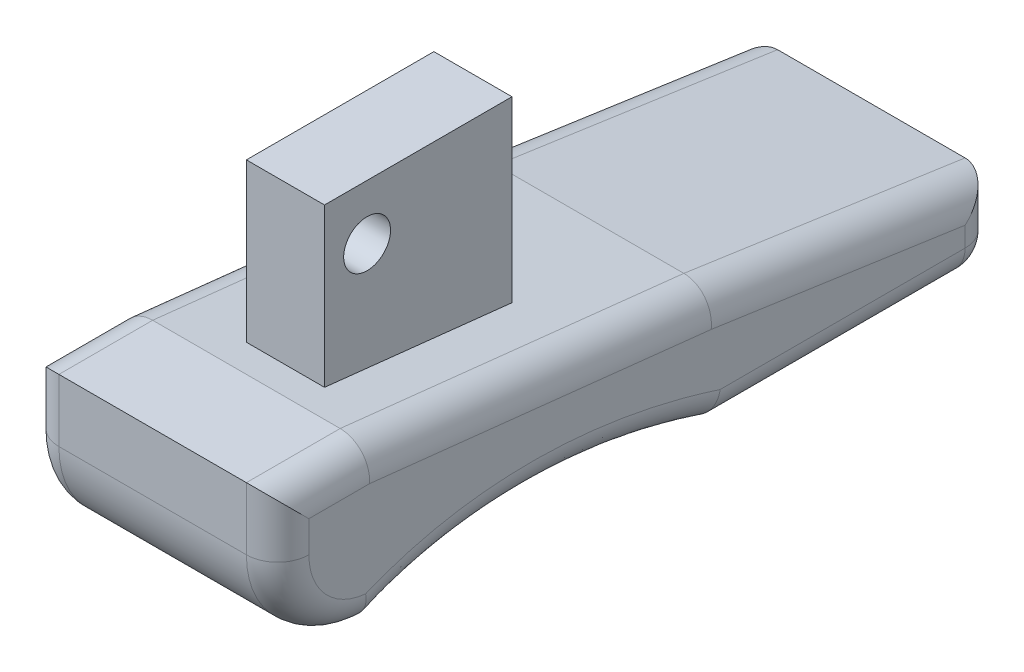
ISO-10303-21;
HEADER;
FILE_DESCRIPTION(('STEP AP214'),'2;1');
FILE_NAME('part.step','',(''),(''),'','','');
FILE_SCHEMA(('AUTOMOTIVE_DESIGN { 1 0 10303 214 1 1 1 1 }'));
ENDSEC;
DATA;
#1=APPLICATION_CONTEXT('core data for automotive mechanical design processes');
#2=APPLICATION_PROTOCOL_DEFINITION('international standard','automotive_design',2000,#1);
#3=PRODUCT_CONTEXT('',#1,'mechanical');
#4=PRODUCT('Part','Part','',(#3));
#5=PRODUCT_RELATED_PRODUCT_CATEGORY('part','',(#4));
#6=PRODUCT_DEFINITION_FORMATION('','',#4);
#7=PRODUCT_DEFINITION_CONTEXT('part definition',#1,'design');
#8=PRODUCT_DEFINITION('design','',#6,#7);
#9=PRODUCT_DEFINITION_SHAPE('','',#8);
#10=(LENGTH_UNIT() NAMED_UNIT(*) SI_UNIT(.MILLI.,.METRE.));
#11=(NAMED_UNIT(*) PLANE_ANGLE_UNIT() SI_UNIT($,.RADIAN.));
#12=(NAMED_UNIT(*) SI_UNIT($,.STERADIAN.) SOLID_ANGLE_UNIT());
#13=UNCERTAINTY_MEASURE_WITH_UNIT(LENGTH_MEASURE(1.E-05),#10,'distance_accuracy_value','');
#14=(GEOMETRIC_REPRESENTATION_CONTEXT(3) GLOBAL_UNCERTAINTY_ASSIGNED_CONTEXT((#13)) GLOBAL_UNIT_ASSIGNED_CONTEXT((#10,
#11,#12)) REPRESENTATION_CONTEXT('',''));
#15=CARTESIAN_POINT('',(0.,0.,0.));
#16=DIRECTION('',(0.,0.,1.));
#17=DIRECTION('',(1.,0.,0.));
#18=AXIS2_PLACEMENT_3D('',#15,#16,#17);
#19=CARTESIAN_POINT('',(80.,0.,-90.));
#20=DIRECTION('',(0.,1.,0.));
#21=DIRECTION('',(0.,0.,1.));
#22=AXIS2_PLACEMENT_3D('',#19,#20,#21);
#23=PLANE('',#22);
#24=DIRECTION('',(-1.,0.,0.));
#25=VECTOR('',#24,1.);
#26=CARTESIAN_POINT('',(80.,0.,0.));
#27=LINE('',#26,#25);
#28=CARTESIAN_POINT('',(70.,0.,0.));
#29=VERTEX_POINT('',#28);
#30=CARTESIAN_POINT('',(9.99999999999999,0.,0.));
#31=VERTEX_POINT('',#30);
#32=EDGE_CURVE('E224',#29,#31,#27,.T.);
#33=ORIENTED_EDGE('',*,*,#32,.T.);
#34=DIRECTION('',(0.,0.,-1.));
#35=VECTOR('',#34,1.);
#36=CARTESIAN_POINT('',(9.99999999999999,0.,-90.));
#37=LINE('',#36,#35);
#38=CARTESIAN_POINT('',(9.99999999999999,0.,-80.));
#39=VERTEX_POINT('',#38);
#40=EDGE_CURVE('E379',#31,#39,#37,.T.);
#41=ORIENTED_EDGE('',*,*,#40,.T.);
#42=DIRECTION('',(-1.,0.,0.));
#43=VECTOR('',#42,1.);
#44=CARTESIAN_POINT('',(80.,0.,-80.));
#45=LINE('',#44,#43);
#46=CARTESIAN_POINT('',(70.,0.,-80.));
#47=VERTEX_POINT('',#46);
#48=EDGE_CURVE('E360',#39,#47,#45,.F.);
#49=ORIENTED_EDGE('',*,*,#48,.T.);
#50=DIRECTION('',(0.,0.,-1.));
#51=VECTOR('',#50,1.);
#52=CARTESIAN_POINT('',(70.,0.,0.));
#53=LINE('',#52,#51);
#54=EDGE_CURVE('E540',#47,#29,#53,.F.);
#55=ORIENTED_EDGE('',*,*,#54,.T.);
#56=EDGE_LOOP('',(#33,#41,#49,#55));
#57=FACE_BOUND('',#56,.T.);
#58=ADVANCED_FACE('F45',(#57),#23,.F.);
#59=CARTESIAN_POINT('',(80.,25.,-90.));
#60=DIRECTION('',(0.,0.,1.));
#61=DIRECTION('',(0.,-1.,0.));
#62=AXIS2_PLACEMENT_3D('',#59,#60,#61);
#63=PLANE('',#62);
#64=DIRECTION('',(-1.,0.,0.));
#65=VECTOR('',#64,1.);
#66=CARTESIAN_POINT('',(80.,10.,-90.));
#67=LINE('',#66,#65);
#68=CARTESIAN_POINT('',(70.,10.,-90.));
#69=VERTEX_POINT('',#68);
#70=CARTESIAN_POINT('',(9.99999999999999,10.,-90.));
#71=VERTEX_POINT('',#70);
#72=EDGE_CURVE('E370',#69,#71,#67,.T.);
#73=ORIENTED_EDGE('',*,*,#72,.T.);
#74=DIRECTION('',(0.,1.,0.));
#75=VECTOR('',#74,1.);
#76=CARTESIAN_POINT('',(9.99999999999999,25.,-90.));
#77=LINE('',#76,#75);
#78=CARTESIAN_POINT('',(9.99999999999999,25.,-90.));
#79=VERTEX_POINT('',#78);
#80=EDGE_CURVE('E392',#71,#79,#77,.T.);
#81=ORIENTED_EDGE('',*,*,#80,.T.);
#82=DIRECTION('',(-1.,0.,0.));
#83=VECTOR('',#82,1.);
#84=CARTESIAN_POINT('',(80.,25.,-90.));
#85=LINE('',#84,#83);
#86=CARTESIAN_POINT('',(70.,25.,-90.));
#87=VERTEX_POINT('',#86);
#88=EDGE_CURVE('E478',#87,#79,#85,.T.);
#89=ORIENTED_EDGE('',*,*,#88,.F.);
#90=DIRECTION('',(0.,1.,0.));
#91=VECTOR('',#90,1.);
#92=CARTESIAN_POINT('',(70.,10.,-90.));
#93=LINE('',#92,#91);
#94=EDGE_CURVE('E390',#87,#69,#93,.F.);
#95=ORIENTED_EDGE('',*,*,#94,.T.);
#96=EDGE_LOOP('',(#73,#81,#89,#95));
#97=FACE_BOUND('',#96,.T.);
#98=ADVANCED_FACE('F335',(#97),#63,.F.);
#99=CARTESIAN_POINT('',(80.,38.,0.));
#100=DIRECTION('',(0.,-0.989728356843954,0.142960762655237));
#101=DIRECTION('',(0.,-0.142960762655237,-0.989728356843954));
#102=AXIS2_PLACEMENT_3D('',#99,#100,#101);
#103=PLANE('',#102);
#104=ORIENTED_EDGE('',*,*,#88,.T.);
#105=DIRECTION('',(0.,0.142960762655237,0.989728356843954));
#106=VECTOR('',#105,1.);
#107=CARTESIAN_POINT('',(9.99999999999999,38.,0.));
#108=LINE('',#107,#106);
#109=CARTESIAN_POINT('',(9.99999999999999,38.,0.));
#110=VERTEX_POINT('',#109);
#111=EDGE_CURVE('E492',#79,#110,#108,.T.);
#112=ORIENTED_EDGE('',*,*,#111,.T.);
#113=DIRECTION('',(-1.,0.,0.));
#114=VECTOR('',#113,1.);
#115=CARTESIAN_POINT('',(80.,38.,0.));
#116=LINE('',#115,#114);
#117=CARTESIAN_POINT('',(70.,38.,0.));
#118=VERTEX_POINT('',#117);
#119=EDGE_CURVE('E468',#118,#110,#116,.T.);
#120=ORIENTED_EDGE('',*,*,#119,.F.);
#121=DIRECTION('',(0.,0.142960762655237,0.989728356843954));
#122=VECTOR('',#121,1.);
#123=CARTESIAN_POINT('',(70.,25.,-90.));
#124=LINE('',#123,#122);
#125=EDGE_CURVE('E369',#118,#87,#124,.F.);
#126=ORIENTED_EDGE('',*,*,#125,.T.);
#127=EDGE_LOOP('',(#104,#112,#120,#126));
#128=FACE_BOUND('',#127,.T.);
#129=ADVANCED_FACE('F341',(#128),#103,.F.);
#130=CARTESIAN_POINT('',(80.,50.,110.));
#131=DIRECTION('',(0.,-0.994102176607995,0.108447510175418));
#132=DIRECTION('',(0.,-0.108447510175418,-0.994102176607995));
#133=AXIS2_PLACEMENT_3D('',#130,#131,#132);
#134=PLANE('',#133);
#135=DIRECTION('',(-1.,0.,0.));
#136=VECTOR('',#135,1.);
#137=CARTESIAN_POINT('',(80.,48.9090909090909,100.));
#138=LINE('',#137,#136);
#139=CARTESIAN_POINT('',(55.,48.9090909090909,100.));
#140=VERTEX_POINT('',#139);
#141=CARTESIAN_POINT('',(30.,48.9090909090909,100.));
#142=VERTEX_POINT('',#141);
#143=EDGE_CURVE('E53',#140,#142,#138,.T.);
#144=ORIENTED_EDGE('',*,*,#143,.T.);
#145=DIRECTION('',(0.,-0.108447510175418,-0.994102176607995));
#146=VECTOR('',#145,1.);
#147=CARTESIAN_POINT('',(30.,50.,110.));
#148=LINE('',#147,#146);
#149=CARTESIAN_POINT('',(30.,42.3636363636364,40.));
#150=VERTEX_POINT('',#149);
#151=EDGE_CURVE('E11',#142,#150,#148,.T.);
#152=ORIENTED_EDGE('',*,*,#151,.T.);
#153=DIRECTION('',(1.,0.,0.));
#154=VECTOR('',#153,1.);
#155=CARTESIAN_POINT('',(30.,42.3636363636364,40.));
#156=LINE('',#155,#154);
#157=CARTESIAN_POINT('',(55.,42.3636363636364,40.));
#158=VERTEX_POINT('',#157);
#159=EDGE_CURVE('E193',#150,#158,#156,.T.);
#160=ORIENTED_EDGE('',*,*,#159,.T.);
#161=DIRECTION('',(0.,-0.108447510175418,-0.994102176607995));
#162=VECTOR('',#161,1.);
#163=CARTESIAN_POINT('',(55.,50.,110.));
#164=LINE('',#163,#162);
#165=EDGE_CURVE('E302',#140,#158,#164,.T.);
#166=ORIENTED_EDGE('',*,*,#165,.F.);
#167=EDGE_LOOP('',(#144,#152,#160,#166));
#168=FACE_BOUND('',#167,.T.);
#169=ORIENTED_EDGE('',*,*,#119,.T.);
#170=DIRECTION('',(0.,0.108447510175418,0.994102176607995));
#171=VECTOR('',#170,1.);
#172=CARTESIAN_POINT('',(9.99999999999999,50.,110.));
#173=LINE('',#172,#171);
#174=CARTESIAN_POINT('',(9.99999999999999,50.,110.));
#175=VERTEX_POINT('',#174);
#176=EDGE_CURVE('E471',#110,#175,#173,.T.);
#177=ORIENTED_EDGE('',*,*,#176,.T.);
#178=DIRECTION('',(-1.,0.,0.));
#179=VECTOR('',#178,1.);
#180=CARTESIAN_POINT('',(80.,50.,110.));
#181=LINE('',#180,#179);
#182=CARTESIAN_POINT('',(70.,50.,110.));
#183=VERTEX_POINT('',#182);
#184=EDGE_CURVE('E479',#183,#175,#181,.T.);
#185=ORIENTED_EDGE('',*,*,#184,.F.);
#186=DIRECTION('',(0.,0.108447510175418,0.994102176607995));
#187=VECTOR('',#186,1.);
#188=CARTESIAN_POINT('',(70.,38.,0.));
#189=LINE('',#188,#187);
#190=EDGE_CURVE('E474',#183,#118,#189,.F.);
#191=ORIENTED_EDGE('',*,*,#190,.T.);
#192=EDGE_LOOP('',(#169,#177,#185,#191));
#193=FACE_BOUND('',#192,.T.);
#194=ADVANCED_FACE('F461',(#168,#193),#134,.F.);
#195=CARTESIAN_POINT('',(80.,50.,140.));
#196=DIRECTION('',(0.,-1.,0.));
#197=DIRECTION('',(0.,0.,-1.));
#198=AXIS2_PLACEMENT_3D('',#195,#196,#197);
#199=PLANE('',#198);
#200=ORIENTED_EDGE('',*,*,#184,.T.);
#201=DIRECTION('',(0.,0.,1.));
#202=VECTOR('',#201,1.);
#203=CARTESIAN_POINT('',(9.99999999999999,50.,140.));
#204=LINE('',#203,#202);
#205=CARTESIAN_POINT('',(9.99999999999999,50.,140.));
#206=VERTEX_POINT('',#205);
#207=EDGE_CURVE('E518',#175,#206,#204,.T.);
#208=ORIENTED_EDGE('',*,*,#207,.T.);
#209=DIRECTION('',(-1.,0.,0.));
#210=VECTOR('',#209,1.);
#211=CARTESIAN_POINT('',(80.,50.,140.));
#212=LINE('',#211,#210);
#213=CARTESIAN_POINT('',(70.,50.,140.));
#214=VERTEX_POINT('',#213);
#215=EDGE_CURVE('E484',#214,#206,#212,.T.);
#216=ORIENTED_EDGE('',*,*,#215,.F.);
#217=DIRECTION('',(0.,0.,1.));
#218=VECTOR('',#217,1.);
#219=CARTESIAN_POINT('',(70.,50.,110.));
#220=LINE('',#219,#218);
#221=EDGE_CURVE('E516',#214,#183,#220,.F.);
#222=ORIENTED_EDGE('',*,*,#221,.T.);
#223=EDGE_LOOP('',(#200,#208,#216,#222));
#224=FACE_BOUND('',#223,.T.);
#225=ADVANCED_FACE('F464',(#224),#199,.F.);
#226=CARTESIAN_POINT('',(80.,0.,140.));
#227=DIRECTION('',(0.,0.,-1.));
#228=DIRECTION('',(0.,1.,0.));
#229=AXIS2_PLACEMENT_3D('',#226,#227,#228);
#230=PLANE('',#229);
#231=ORIENTED_EDGE('',*,*,#215,.T.);
#232=DIRECTION('',(0.,-1.,0.));
#233=VECTOR('',#232,1.);
#234=CARTESIAN_POINT('',(9.99999999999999,0.,140.));
#235=LINE('',#234,#233);
#236=CARTESIAN_POINT('',(9.99999999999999,30.,140.));
#237=VERTEX_POINT('',#236);
#238=EDGE_CURVE('E522',#206,#237,#235,.T.);
#239=ORIENTED_EDGE('',*,*,#238,.T.);
#240=DIRECTION('',(-1.,0.,0.));
#241=VECTOR('',#240,1.);
#242=CARTESIAN_POINT('',(80.,30.,140.));
#243=LINE('',#242,#241);
#244=CARTESIAN_POINT('',(70.,30.,140.));
#245=VERTEX_POINT('',#244);
#246=EDGE_CURVE('E482',#237,#245,#243,.F.);
#247=ORIENTED_EDGE('',*,*,#246,.T.);
#248=DIRECTION('',(0.,-1.,0.));
#249=VECTOR('',#248,1.);
#250=CARTESIAN_POINT('',(70.,50.,140.));
#251=LINE('',#250,#249);
#252=EDGE_CURVE('E520',#245,#214,#251,.F.);
#253=ORIENTED_EDGE('',*,*,#252,.T.);
#254=EDGE_LOOP('',(#231,#239,#247,#253));
#255=FACE_BOUND('',#254,.T.);
#256=ADVANCED_FACE('F236',(#255),#230,.F.);
#257=CARTESIAN_POINT('',(80.,0.,110.));
#258=CARTESIAN_POINT('',(80.,15.1909835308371,75.3452807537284));
#259=CARTESIAN_POINT('',(80.,11.7307859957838,35.0571858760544));
#260=CARTESIAN_POINT('',(80.,0.,0.));
#261=B_SPLINE_CURVE_WITH_KNOTS('',3,(#257,#258,#259,#260),.UNSPECIFIED.,.F.,.F.,(4,4),(0.,1.),.UNSPECIFIED.);
#262=DIRECTION('',(-1.,0.,0.));
#263=VECTOR('',#262,1.);
#264=SURFACE_OF_LINEAR_EXTRUSION('',#261,#263);
#265=DIRECTION('',(-1.,0.,0.));
#266=VECTOR('',#265,1.);
#267=CARTESIAN_POINT('',(80.,0.,110.));
#268=LINE('',#267,#266);
#269=CARTESIAN_POINT('',(70.,0.,110.));
#270=VERTEX_POINT('',#269);
#271=CARTESIAN_POINT('',(9.99999999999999,0.,110.));
#272=VERTEX_POINT('',#271);
#273=EDGE_CURVE('E527',#270,#272,#268,.T.);
#274=ORIENTED_EDGE('',*,*,#273,.T.);
#275=CARTESIAN_POINT('',(0.,-10.6888464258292,159.292341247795));
#276=CARTESIAN_POINT('',(0.,-19.8475502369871,155.277600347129));
#277=CARTESIAN_POINT('',(9.99999999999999,-19.8475502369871,155.277600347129));
#278=CARTESIAN_POINT('',(0.,-4.07299641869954,144.199807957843));
#279=CARTESIAN_POINT('',(0.,-13.2317002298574,140.185067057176));
#280=CARTESIAN_POINT('',(9.99999999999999,-13.2317002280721,140.185067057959));
#281=CARTESIAN_POINT('',(0.,2.54285358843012,129.10727466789));
#282=CARTESIAN_POINT('',(0.,-6.61585022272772,125.092533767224));
#283=CARTESIAN_POINT('',(9.99999999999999,-6.61585021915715,125.092533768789));
#284=CARTESIAN_POINT('',(0.,9.15870359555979,114.014741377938));
#285=CARTESIAN_POINT('',(0.,-2.15598055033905E-07,110.000000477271));
#286=CARTESIAN_POINT('',(9.99999999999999,-2.10242202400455E-07,110.000000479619));
#287=CARTESIAN_POINT('',(0.,9.46235985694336,113.322016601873));
#288=CARTESIAN_POINT('',(0.,0.278564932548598,109.364515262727));
#289=CARTESIAN_POINT('',(9.99999999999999,0.278564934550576,109.364515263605));
#290=CARTESIAN_POINT('',(0.,9.75950824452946,112.626479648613));
#291=CARTESIAN_POINT('',(0.,0.551233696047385,108.726282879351));
#292=CARTESIAN_POINT('',(9.99999999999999,0.551233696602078,108.726282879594));
#293=CARTESIAN_POINT('',(0.,10.3409059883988,111.229725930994));
#294=CARTESIAN_POINT('',(0.,1.08488788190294,107.444228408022));
#295=CARTESIAN_POINT('',(9.99999999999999,1.08488788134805,107.444228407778));
#296=CARTESIAN_POINT('',(0.,10.6251504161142,110.528507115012));
#297=CARTESIAN_POINT('',(0.,1.34586883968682,106.800404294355));
#298=CARTESIAN_POINT('',(9.99999999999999,1.34586883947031,106.80040429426));
#299=CARTESIAN_POINT('',(0.,11.7574920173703,107.659010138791));
#300=CARTESIAN_POINT('',(0.,2.3858671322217,104.164919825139));
#301=CARTESIAN_POINT('',(9.99999999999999,2.38586713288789,104.164919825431));
#302=CARTESIAN_POINT('',(0.,12.5504949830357,105.468672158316));
#303=CARTESIAN_POINT('',(0.,3.11498711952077,102.151228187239));
#304=CARTESIAN_POINT('',(9.99999999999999,3.1149871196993,102.151228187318));
#305=CARTESIAN_POINT('',(0.,14.0137687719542,101.046956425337));
#306=CARTESIAN_POINT('',(0.,4.46192377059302,98.0810548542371));
#307=CARTESIAN_POINT('',(9.99999999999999,4.46192377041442,98.0810548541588));
#308=CARTESIAN_POINT('',(0.,14.6840045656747,98.8155671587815));
#309=CARTESIAN_POINT('',(0.,5.07970866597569,96.0245611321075));
#310=CARTESIAN_POINT('',(9.99999999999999,5.07970866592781,96.0245611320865));
#311=CARTESIAN_POINT('',(0.,15.9040371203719,94.3175026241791));
#312=CARTESIAN_POINT('',(0.,6.20571407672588,91.8731574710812));
#313=CARTESIAN_POINT('',(9.99999999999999,6.20571407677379,91.8731574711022));
#314=CARTESIAN_POINT('',(0.,16.4537011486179,92.0507913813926));
#315=CARTESIAN_POINT('',(0.,6.71381383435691,89.778207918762));
#316=CARTESIAN_POINT('',(9.99999999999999,6.71381383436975,89.7782079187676));
#317=CARTESIAN_POINT('',(0.,17.4344399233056,87.4918258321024));
#318=CARTESIAN_POINT('',(0.,7.62163373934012,85.5582023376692));
#319=CARTESIAN_POINT('',(9.99999999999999,7.62163373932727,85.5582023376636));
#320=CARTESIAN_POINT('',(0.,17.8655082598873,85.199570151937));
#321=CARTESIAN_POINT('',(0.,8.02134802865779,83.4331446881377));
#322=CARTESIAN_POINT('',(9.99999999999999,8.02134802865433,83.4331446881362));
#323=CARTESIAN_POINT('',(0.,18.6139748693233,80.5877739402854));
#324=CARTESIAN_POINT('',(0.,8.71633493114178,79.1508688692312));
#325=CARTESIAN_POINT('',(9.99999999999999,8.71633493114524,79.1508688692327));
#326=CARTESIAN_POINT('',(0.,18.9309381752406,78.2681630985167));
#327=CARTESIAN_POINT('',(0.,9.01120783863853,76.9935596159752));
#328=CARTESIAN_POINT('',(9.99999999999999,9.01120783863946,76.9935596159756));
#329=CARTESIAN_POINT('',(0.,19.4530512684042,73.6163841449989));
#330=CARTESIAN_POINT('',(0.,9.49757874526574,72.6602228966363));
#331=CARTESIAN_POINT('',(9.99999999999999,9.49757874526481,72.6602228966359));
#332=CARTESIAN_POINT('',(0.,19.6581967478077,71.2842155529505));
#333=CARTESIAN_POINT('',(0.,9.68907276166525,70.4841947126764));
#334=CARTESIAN_POINT('',(9.99999999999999,9.689072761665,70.4841947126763));
#335=CARTESIAN_POINT('',(0.,19.9610400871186,66.6143308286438));
#336=CARTESIAN_POINT('',(0.,9.97209279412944,66.1199827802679));
#337=CARTESIAN_POINT('',(9.99999999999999,9.97209279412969,66.119982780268));
#338=CARTESIAN_POINT('',(0.,20.0587997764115,64.2766186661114));
#339=CARTESIAN_POINT('',(0.,10.0636763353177,63.9318067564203));
#340=CARTESIAN_POINT('',(9.99999999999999,10.0636763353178,63.9318067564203));
#341=CARTESIAN_POINT('',(0.,20.1517109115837,59.5991476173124));
#342=CARTESIAN_POINT('',(0.,10.1507784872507,59.5467822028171));
#343=CARTESIAN_POINT('',(9.99999999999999,10.1507784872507,59.546782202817));
#344=CARTESIAN_POINT('',(0.,20.1468579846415,57.2593886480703));
#345=CARTESIAN_POINT('',(0.,10.146293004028,57.349933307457));
#346=CARTESIAN_POINT('',(9.99999999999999,10.146293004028,57.349933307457));
#347=CARTESIAN_POINT('',(0.,20.0307277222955,52.2154137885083));
#348=CARTESIAN_POINT('',(0.,10.0370955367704,52.6071160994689));
#349=CARTESIAN_POINT('',(9.99999999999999,10.0370955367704,52.6071160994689));
#350=CARTESIAN_POINT('',(0.,19.9028825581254,49.5115762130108));
#351=CARTESIAN_POINT('',(0.,9.91677851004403,50.0604174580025));
#352=CARTESIAN_POINT('',(9.99999999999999,9.91677851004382,50.0604174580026));
#353=CARTESIAN_POINT('',(0.,19.523119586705,44.1133295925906));
#354=CARTESIAN_POINT('',(0.,9.55852950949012,44.9679853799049));
#355=CARTESIAN_POINT('',(9.99999999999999,9.55852950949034,44.9679853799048));
#356=CARTESIAN_POINT('',(0.,19.2712276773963,41.4189186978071));
#357=CARTESIAN_POINT('',(0.,9.32062208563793,42.4222518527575));
#358=CARTESIAN_POINT('',(9.99999999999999,9.32062208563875,42.4222518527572));
#359=CARTESIAN_POINT('',(0.,18.6507902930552,36.0504713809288));
#360=CARTESIAN_POINT('',(0.,8.7335979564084,37.3429181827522));
#361=CARTESIAN_POINT('',(9.99999999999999,8.73359795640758,37.3429181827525));
#362=CARTESIAN_POINT('',(0.,18.2825380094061,33.376400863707));
#363=CARTESIAN_POINT('',(0.,8.38476074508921,34.8093036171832));
#364=CARTESIAN_POINT('',(9.99999999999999,8.38476074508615,34.8093036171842));
#365=CARTESIAN_POINT('',(0.,17.4352638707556,28.0458806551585));
#366=CARTESIAN_POINT('',(0.,7.58099733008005,29.7525265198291));
#367=CARTESIAN_POINT('',(9.99999999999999,7.58099733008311,29.7525265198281));
#368=CARTESIAN_POINT('',(0.,16.9562406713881,25.3894311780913));
#369=CARTESIAN_POINT('',(0.,7.12606983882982,27.2293641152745));
#370=CARTESIAN_POINT('',(9.99999999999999,7.12606983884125,27.2293641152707));
#371=CARTESIAN_POINT('',(0.,15.9840052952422,20.550968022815));
#372=CARTESIAN_POINT('',(0.,6.20163349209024,22.6287755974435));
#373=CARTESIAN_POINT('',(9.99999999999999,6.20163349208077,22.6287755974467));
#374=CARTESIAN_POINT('',(0.,15.5072735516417,18.3656177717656));
#375=CARTESIAN_POINT('',(0.,5.74796551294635,20.5490186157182));
#376=CARTESIAN_POINT('',(9.99999999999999,5.7479655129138,20.5490186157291));
#377=CARTESIAN_POINT('',(0.,14.4843244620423,14.0113255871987));
#378=CARTESIAN_POINT('',(0.,4.77370221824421,16.4019617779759));
#379=CARTESIAN_POINT('',(9.99999999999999,4.77370221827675,16.401961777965));
#380=CARTESIAN_POINT('',(0.,13.9381096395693,11.8423830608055));
#381=CARTESIAN_POINT('',(0.,4.25310933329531,14.3346614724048));
#382=CARTESIAN_POINT('',(9.99999999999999,4.25310933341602,14.3346614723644));
#383=CARTESIAN_POINT('',(0.,12.77822055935,7.52073470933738));
#384=CARTESIAN_POINT('',(0.,3.14686866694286,10.2129078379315));
#385=CARTESIAN_POINT('',(9.99999999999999,3.14686866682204,10.2129078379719));
#386=CARTESIAN_POINT('',(0.,12.1644913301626,5.36804366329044));
#387=CARTESIAN_POINT('',(0.,2.56116786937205,8.15846643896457));
#388=CARTESIAN_POINT('',(9.99999999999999,2.56116786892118,8.15846643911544));
#389=CARTESIAN_POINT('',(0.,10.8720472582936,1.08229579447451));
#390=CARTESIAN_POINT('',(0.,1.32708875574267,4.06623859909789));
#391=CARTESIAN_POINT('',(9.99999999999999,1.32708875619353,4.06623859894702));
#392=CARTESIAN_POINT('',(0.,10.1933336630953,-1.05076140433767));
#393=CARTESIAN_POINT('',(0.,0.678711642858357,2.02845183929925));
#394=CARTESIAN_POINT('',(9.99999999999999,0.678711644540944,2.02845183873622));
#395=CARTESIAN_POINT('',(0.,9.4831701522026,-3.17324498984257));
#396=CARTESIAN_POINT('',(0.,4.75671585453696E-10,1.69911701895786E-08));
#397=CARTESIAN_POINT('',(9.99999999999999,5.16095237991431E-09,1.54233882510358E-08));
#398=CARTESIAN_POINT('',(0.,8.89936081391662,-4.91794586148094));
#399=CARTESIAN_POINT('',(0.,-0.583809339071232,-1.74470085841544));
#400=CARTESIAN_POINT('',(9.99999999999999,-0.583809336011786,-1.74470085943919));
#401=CARTESIAN_POINT('',(0.,8.31555147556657,-6.66264673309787));
#402=CARTESIAN_POINT('',(0.,-1.16761867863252,-3.4894017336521));
#403=CARTESIAN_POINT('',(9.99999999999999,-1.16761867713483,-3.48940173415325));
#404=CARTESIAN_POINT('',(0.,-5.91449190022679,-49.1888062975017));
#405=CARTESIAN_POINT('',(0.,-15.3976620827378,-46.0155613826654));
#406=CARTESIAN_POINT('',(9.99999999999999,-15.3976621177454,-46.0155613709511));
#407=CARTESIAN_POINT('',(0.,-19.5607259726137,-89.970264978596));
#408=CARTESIAN_POINT('',(0.,-29.0438961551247,-86.7970200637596));
#409=CARTESIAN_POINT('',(9.99999999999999,-29.0438961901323,-86.7970200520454));
#410=CARTESIAN_POINT('',(0.,-33.2069600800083,-130.751723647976));
#411=CARTESIAN_POINT('',(0.,-42.6901302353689,-127.578478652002));
#412=CARTESIAN_POINT('',(9.99999999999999,-42.6901302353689,-127.578478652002));
#413=(BOUNDED_SURFACE() B_SPLINE_SURFACE(3,2,((#275,#276,#277),(#278,#279,#280),(#281,#282,
#283),(#284,#285,#286),(#287,#288,#289),(#290,#291,#292),(#293,#294,#295),(#296,#297,#298),
(#299,#300,#301),(#302,#303,#304),(#305,#306,#307),(#308,#309,#310),(#311,#312,#313),(#314,#315,
#316),(#317,#318,#319),(#320,#321,#322),(#323,#324,#325),(#326,#327,#328),(#329,#330,#331),
(#332,#333,#334),(#335,#336,#337),(#338,#339,#340),(#341,#342,#343),(#344,#345,#346),(#347,#348,
#349),(#350,#351,#352),(#353,#354,#355),(#356,#357,#358),(#359,#360,#361),(#362,#363,#364),
(#365,#366,#367),(#368,#369,#370),(#371,#372,#373),(#374,#375,#376),(#377,#378,#379),(#380,#381,
#382),(#383,#384,#385),(#386,#387,#388),(#389,#390,#391),(#392,#393,#394),(#395,#396,#397),
(#398,#399,#400),(#401,#402,#403),(#404,#405,#406),(#407,#408,#409),(#410,#411,#412)),
.UNSPECIFIED.,.F.,.F.,.F.) B_SPLINE_SURFACE_WITH_KNOTS((4,3,2,2,2,2,2,2,2,2,2,2,2,2,2,2,2,2,2,3,
2,4),(3,3),(0.,49.4366897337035,51.7056518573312,53.9754734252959,60.9597367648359,
67.945989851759,74.9398956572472,81.9341793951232,88.9548497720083,95.9757906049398,
102.992686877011,110.009882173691,118.127360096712,126.243144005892,134.338639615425,
142.434233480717,149.143344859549,155.852212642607,162.566583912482,169.28082631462,
174.800185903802,303.812292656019),(0.,1.),
.UNSPECIFIED.) GEOMETRIC_REPRESENTATION_ITEM() RATIONAL_B_SPLINE_SURFACE(((1.,0.707106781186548,
1.),(1.,0.707106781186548,1.),(1.,0.707106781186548,1.),(1.,0.707106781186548,1.),(1.,
0.707106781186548,1.),(1.,0.707106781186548,1.),(1.,0.707106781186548,1.),(1.,0.707106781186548,
1.),(1.,0.707106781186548,1.),(1.,0.707106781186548,1.),(1.,0.707106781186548,1.),(1.,
0.707106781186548,1.),(1.,0.707106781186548,1.),(1.,0.707106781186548,1.),(1.,0.707106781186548,
1.),(1.,0.707106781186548,1.),(1.,0.707106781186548,1.),(1.,0.707106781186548,1.),(1.,
0.707106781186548,1.),(1.,0.707106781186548,1.),(1.,0.707106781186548,1.),(1.,0.707106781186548,
1.),(1.,0.707106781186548,1.),(1.,0.707106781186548,1.),(1.,0.707106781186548,1.),(1.,
0.707106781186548,1.),(1.,0.707106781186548,1.),(1.,0.707106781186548,1.),(1.,0.707106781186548,
1.),(1.,0.707106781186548,1.),(1.,0.707106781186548,1.),(1.,0.707106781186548,1.),(1.,
0.707106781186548,1.),(1.,0.707106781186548,1.),(1.,0.707106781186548,1.),(1.,0.707106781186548,
1.),(1.,0.707106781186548,1.),(1.,0.707106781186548,1.),(1.,0.707106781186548,1.),(1.,
0.707106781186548,1.),(1.,0.707106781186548,1.),(1.,0.707106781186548,1.),(1.,0.707106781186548,
1.),(1.,0.707106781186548,1.),(1.,0.707106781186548,1.),(1.,0.707106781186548,1.))) REPRESENTATION_ITEM('') SURFACE());
#414=CARTESIAN_POINT('',(9.99999999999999,-19.8475502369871,155.277600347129));
#415=CARTESIAN_POINT('',(9.99999999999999,-13.2317002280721,140.185067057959));
#416=CARTESIAN_POINT('',(9.99999999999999,-6.61585021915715,125.092533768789));
#417=CARTESIAN_POINT('',(9.99999999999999,-2.10242202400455E-07,110.000000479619));
#418=CARTESIAN_POINT('',(9.99999999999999,0.278564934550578,109.364515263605));
#419=CARTESIAN_POINT('',(9.99999999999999,0.551233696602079,108.726282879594));
#420=CARTESIAN_POINT('',(9.99999999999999,1.08488788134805,107.444228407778));
#421=CARTESIAN_POINT('',(9.99999999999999,1.34586883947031,106.80040429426));
#422=CARTESIAN_POINT('',(9.99999999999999,2.38586713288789,104.164919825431));
#423=CARTESIAN_POINT('',(9.99999999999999,3.1149871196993,102.151228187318));
#424=CARTESIAN_POINT('',(9.99999999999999,4.46192377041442,98.0810548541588));
#425=CARTESIAN_POINT('',(9.99999999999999,5.07970866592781,96.0245611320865));
#426=CARTESIAN_POINT('',(9.99999999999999,6.20571407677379,91.8731574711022));
#427=CARTESIAN_POINT('',(9.99999999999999,6.71381383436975,89.7782079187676));
#428=CARTESIAN_POINT('',(9.99999999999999,7.62163373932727,85.5582023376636));
#429=CARTESIAN_POINT('',(9.99999999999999,8.02134802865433,83.4331446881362));
#430=CARTESIAN_POINT('',(9.99999999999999,8.71633493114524,79.1508688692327));
#431=CARTESIAN_POINT('',(9.99999999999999,9.01120783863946,76.9935596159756));
#432=CARTESIAN_POINT('',(9.99999999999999,9.49757874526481,72.6602228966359));
#433=CARTESIAN_POINT('',(9.99999999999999,9.689072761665,70.4841947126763));
#434=CARTESIAN_POINT('',(9.99999999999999,9.97209279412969,66.119982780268));
#435=CARTESIAN_POINT('',(9.99999999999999,10.0636763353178,63.9318067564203));
#436=CARTESIAN_POINT('',(9.99999999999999,10.1507784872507,59.546782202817));
#437=CARTESIAN_POINT('',(9.99999999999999,10.146293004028,57.349933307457));
#438=CARTESIAN_POINT('',(9.99999999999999,10.0370955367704,52.6071160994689));
#439=CARTESIAN_POINT('',(9.99999999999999,9.91677851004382,50.0604174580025));
#440=CARTESIAN_POINT('',(9.99999999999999,9.55852950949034,44.9679853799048));
#441=CARTESIAN_POINT('',(9.99999999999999,9.32062208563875,42.4222518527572));
#442=CARTESIAN_POINT('',(9.99999999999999,8.73359795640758,37.3429181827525));
#443=CARTESIAN_POINT('',(9.99999999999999,8.38476074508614,34.8093036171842));
#444=CARTESIAN_POINT('',(9.99999999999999,7.58099733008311,29.7525265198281));
#445=CARTESIAN_POINT('',(9.99999999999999,7.12606983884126,27.2293641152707));
#446=CARTESIAN_POINT('',(9.99999999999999,6.20163349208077,22.6287755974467));
#447=CARTESIAN_POINT('',(9.99999999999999,5.7479655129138,20.5490186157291));
#448=CARTESIAN_POINT('',(9.99999999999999,4.77370221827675,16.401961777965));
#449=CARTESIAN_POINT('',(9.99999999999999,4.25310933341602,14.3346614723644));
#450=CARTESIAN_POINT('',(9.99999999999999,3.14686866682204,10.2129078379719));
#451=CARTESIAN_POINT('',(9.99999999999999,2.56116786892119,8.15846643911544));
#452=CARTESIAN_POINT('',(9.99999999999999,1.32708875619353,4.06623859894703));
#453=CARTESIAN_POINT('',(9.99999999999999,0.678711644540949,2.02845183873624));
#454=CARTESIAN_POINT('',(9.99999999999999,5.16095237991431E-09,1.54233882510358E-08));
#455=CARTESIAN_POINT('',(9.99999999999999,-0.583809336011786,-1.74470085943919));
#456=CARTESIAN_POINT('',(9.99999999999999,-1.16761867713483,-3.48940173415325));
#457=CARTESIAN_POINT('',(9.99999999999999,-15.3976621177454,-46.0155613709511));
#458=CARTESIAN_POINT('',(9.99999999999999,-29.0438961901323,-86.7970200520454));
#459=CARTESIAN_POINT('',(9.99999999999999,-42.6901302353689,-127.578478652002));
#460=B_SPLINE_CURVE_WITH_KNOTS('',3,(#414,#415,#416,#417,#418,#419,#420,#421,#422,#423,#424,
#425,#426,#427,#428,#429,#430,#431,#432,#433,#434,#435,#436,#437,#438,#439,#440,#441,#442,#443,
#444,#445,#446,#447,#448,#449,#450,#451,#452,#453,#454,#455,#456,#457,#458,#459),.UNSPECIFIED.,
.F.,.F.,(4,3,2,2,2,2,2,2,2,2,2,2,2,2,2,2,2,2,2,3,2,4),(0.,49.4366897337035,51.7056518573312,
53.9754734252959,60.9597367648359,67.945989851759,74.9398956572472,81.9341793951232,
88.9548497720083,95.9757906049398,102.992686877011,110.009882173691,118.127360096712,
126.243144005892,134.338639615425,142.434233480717,149.143344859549,155.852212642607,
162.566583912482,169.28082631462,174.800185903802,303.812292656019),.UNSPECIFIED.);
#461=EDGE_CURVE('E274',#272,#31,#460,.T.);
#462=ORIENTED_EDGE('',*,*,#461,.T.);
#463=ORIENTED_EDGE('',*,*,#32,.F.);
#464=CARTESIAN_POINT('',(80.,-2.58677181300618,-39.2439907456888));
#465=CARTESIAN_POINT('',(80.,-12.0699419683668,-36.0707457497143));
#466=CARTESIAN_POINT('',(70.,-12.0699419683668,-36.0707457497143));
#467=CARTESIAN_POINT('',(80.,1.43654217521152,-27.2204088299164));
#468=CARTESIAN_POINT('',(80.,-8.04662798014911,-24.0471638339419));
#469=CARTESIAN_POINT('',(70.,-8.04662797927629,-24.0471638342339));
#470=CARTESIAN_POINT('',(80.,5.45985616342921,-15.196826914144));
#471=CARTESIAN_POINT('',(80.,-4.02331399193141,-12.0235819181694));
#472=CARTESIAN_POINT('',(70.,-4.02331399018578,-12.0235819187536));
#473=CARTESIAN_POINT('',(80.,9.48317015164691,-3.17324499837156));
#474=CARTESIAN_POINT('',(80.,-3.71371336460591E-09,-2.39701531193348E-09));
#475=CARTESIAN_POINT('',(70.,-1.09527177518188E-09,-3.27319467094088E-09));
#476=CARTESIAN_POINT('',(80.,10.0230147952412,-1.55987984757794));
#477=CARTESIAN_POINT('',(80.,0.515929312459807,1.54188700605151));
#478=CARTESIAN_POINT('',(70.,0.515929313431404,1.54188700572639));
#479=CARTESIAN_POINT('',(80.,10.5446242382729,0.0594952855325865));
#480=CARTESIAN_POINT('',(80.,1.01427878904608,3.0890748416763));
#481=CARTESIAN_POINT('',(70.,1.01427878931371,3.08907484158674));
#482=CARTESIAN_POINT('',(80.,11.5512637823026,3.31202048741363));
#483=CARTESIAN_POINT('',(80.,1.97569303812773,6.19547453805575));
#484=CARTESIAN_POINT('',(70.,1.97569303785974,6.19547453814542));
#485=CARTESIAN_POINT('',(80.,12.0362424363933,4.94518647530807));
#486=CARTESIAN_POINT('',(80.,2.43870819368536,7.75470004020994));
#487=CARTESIAN_POINT('',(70.,2.43870819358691,7.75470004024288));
#488=CARTESIAN_POINT('',(80.,13.6198014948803,10.5151667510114));
#489=CARTESIAN_POINT('',(80.,3.94989817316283,13.0701474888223));
#490=CARTESIAN_POINT('',(70.,3.94989817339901,13.0701474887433));
#491=CARTESIAN_POINT('',(80.,14.6275989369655,14.4783170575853));
#492=CARTESIAN_POINT('',(80.,4.91048703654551,16.8482173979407));
#493=CARTESIAN_POINT('',(70.,4.9104870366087,16.8482173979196));
#494=CARTESIAN_POINT('',(80.,16.4083368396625,22.458218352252));
#495=CARTESIAN_POINT('',(80.,6.60554731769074,24.444170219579));
#496=CARTESIAN_POINT('',(70.,6.60554731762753,24.4441702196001));
#497=CARTESIAN_POINT('',(80.,17.1812047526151,26.4749854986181));
#498=CARTESIAN_POINT('',(80.,7.33994888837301,28.2620650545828));
#499=CARTESIAN_POINT('',(70.,7.33994888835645,28.2620650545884));
#500=CARTESIAN_POINT('',(80.,18.4733014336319,34.5504003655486));
#501=CARTESIAN_POINT('',(80.,8.56576212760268,35.923240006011));
#502=CARTESIAN_POINT('',(70.,8.56576212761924,35.9232400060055));
#503=CARTESIAN_POINT('',(80.,18.9925026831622,38.6090525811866));
#504=CARTESIAN_POINT('',(80.,9.05714743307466,39.7665228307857));
#505=CARTESIAN_POINT('',(70.,9.05714743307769,39.7665228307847));
#506=CARTESIAN_POINT('',(80.,19.5645718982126,44.7152234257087));
#507=CARTESIAN_POINT('',(80.,9.59765320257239,45.5357140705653));
#508=CARTESIAN_POINT('',(70.,9.59765320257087,45.5357140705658));
#509=CARTESIAN_POINT('',(80.,19.7208007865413,46.7534365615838));
#510=CARTESIAN_POINT('',(80.,9.74505473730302,47.4592921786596));
#511=CARTESIAN_POINT('',(70.,9.74505473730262,47.4592921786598));
#512=CARTESIAN_POINT('',(80.,19.9614994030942,50.8343679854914));
#513=CARTESIAN_POINT('',(80.,9.97194201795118,51.3060771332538));
#514=CARTESIAN_POINT('',(70.,9.97194201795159,51.3060771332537));
#515=CARTESIAN_POINT('',(80.,20.0459620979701,52.8770866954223));
#516=CARTESIAN_POINT('',(80.,10.051421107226,53.2292839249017));
#517=CARTESIAN_POINT('',(70.,10.0514211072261,53.2292839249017));
#518=CARTESIAN_POINT('',(80.,20.1553853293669,57.6297811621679));
#519=CARTESIAN_POINT('',(80.,10.154310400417,57.6982096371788));
#520=CARTESIAN_POINT('',(70.,10.1543104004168,57.6982096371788));
#521=CARTESIAN_POINT('',(80.,20.152020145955,60.3404708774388));
#522=CARTESIAN_POINT('',(80.,10.1510409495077,60.2427429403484));
#523=CARTESIAN_POINT('',(70.,10.1510409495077,60.2427429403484));
#524=CARTESIAN_POINT('',(80.,20.0065980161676,65.7578773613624));
#525=CARTESIAN_POINT('',(80.,10.0147782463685,65.3189587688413));
#526=CARTESIAN_POINT('',(70.,10.0147782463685,65.3189587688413));
#527=CARTESIAN_POINT('',(80.,19.8645581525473,68.4645945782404));
#528=CARTESIAN_POINT('',(80.,9.88180097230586,67.8506428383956));
#529=CARTESIAN_POINT('',(70.,9.88180097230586,67.8506428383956));
#530=CARTESIAN_POINT('',(80.,19.434966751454,73.8627196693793));
#531=CARTESIAN_POINT('',(80.,9.48073577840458,72.8903223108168));
#532=CARTESIAN_POINT('',(70.,9.48073577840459,72.8903223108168));
#533=CARTESIAN_POINT('',(80.,19.1476223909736,76.5541438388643));
#534=CARTESIAN_POINT('',(80.,9.21284022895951,75.3983462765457));
#535=CARTESIAN_POINT('',(70.,9.21284022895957,75.3983462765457));
#536=CARTESIAN_POINT('',(80.,18.4207826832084,81.916489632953));
#537=CARTESIAN_POINT('',(80.,8.53679122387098,80.3859863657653));
#538=CARTESIAN_POINT('',(70.,8.53679122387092,80.3859863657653));
#539=CARTESIAN_POINT('',(80.,17.9812914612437,84.5874118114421));
#540=CARTESIAN_POINT('',(80.,8.1286415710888,82.8656032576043));
#541=CARTESIAN_POINT('',(70.,8.12864157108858,82.8656032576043));
#542=CARTESIAN_POINT('',(80.,17.0148806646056,89.5366879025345));
#543=CARTESIAN_POINT('',(80.,7.23306553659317,87.4521182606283));
#544=CARTESIAN_POINT('',(70.,7.23306553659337,87.4521182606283));
#545=CARTESIAN_POINT('',(80.,16.5080205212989,91.8189645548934));
#546=CARTESIAN_POINT('',(80.,6.7640070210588,89.5637842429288));
#547=CARTESIAN_POINT('',(70.,6.76400702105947,89.5637842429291));
#548=CARTESIAN_POINT('',(80.,15.3733300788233,96.3530422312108));
#549=CARTESIAN_POINT('',(80.,5.71566634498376,93.7528213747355));
#550=CARTESIAN_POINT('',(70.,5.71566634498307,93.7528213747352));
#551=CARTESIAN_POINT('',(80.,14.7455137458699,98.6048467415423));
#552=CARTESIAN_POINT('',(80.,5.13639691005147,95.8301964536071));
#553=CARTESIAN_POINT('',(70.,5.13639691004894,95.830196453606));
#554=CARTESIAN_POINT('',(80.,13.3645500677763,103.077244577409));
#555=CARTESIAN_POINT('',(80.,3.86405759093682,99.9508075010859));
#556=CARTESIAN_POINT('',(70.,3.86405759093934,99.950807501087));
#557=CARTESIAN_POINT('',(80.,12.6110357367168,105.297725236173));
#558=CARTESIAN_POINT('',(80.,3.170654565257,101.993923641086));
#559=CARTESIAN_POINT('',(70.,3.17065456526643,101.99392364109));
#560=CARTESIAN_POINT('',(80.,11.3869621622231,108.593755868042));
#561=CARTESIAN_POINT('',(80.,2.04557177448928,105.023402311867));
#562=CARTESIAN_POINT('',(70.,2.04557177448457,105.023402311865));
#563=CARTESIAN_POINT('',(80.,10.9632062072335,109.686874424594));
#564=CARTESIAN_POINT('',(80.,1.65629146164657,106.027567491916));
#565=CARTESIAN_POINT('',(70.,1.65629146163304,106.02756749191));
#566=CARTESIAN_POINT('',(80.,10.0844174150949,111.860502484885));
#567=CARTESIAN_POINT('',(80.,0.849398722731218,108.023363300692));
#568=CARTESIAN_POINT('',(70.,0.849398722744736,108.023363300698));
#569=CARTESIAN_POINT('',(80.,9.62938363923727,112.94101160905));
#570=CARTESIAN_POINT('',(80.,0.431785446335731,109.014993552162));
#571=CARTESIAN_POINT('',(70.,0.4317854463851,109.014993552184));
#572=CARTESIAN_POINT('',(80.,9.15870362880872,114.014741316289));
#573=CARTESIAN_POINT('',(80.,1.40485525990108E-07,109.99999967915));
#574=CARTESIAN_POINT('',(70.,1.40619492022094E-07,109.999999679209));
#575=CARTESIAN_POINT('',(80.,7.90549893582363,116.873638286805));
#576=CARTESIAN_POINT('',(80.,-1.25320466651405,112.858896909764));
#577=CARTESIAN_POINT('',(70.,-1.2532046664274,112.858896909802));
#578=CARTESIAN_POINT('',(80.,6.65229424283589,119.732535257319));
#579=CARTESIAN_POINT('',(80.,-2.50640946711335,115.717794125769));
#580=CARTESIAN_POINT('',(70.,-2.50640946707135,115.717794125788));
#581=CARTESIAN_POINT('',(80.,-14.409793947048,167.780823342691));
#582=CARTESIAN_POINT('',(80.,-23.5684993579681,163.766086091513));
#583=CARTESIAN_POINT('',(70.,-23.5684993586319,163.766086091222));
#584=CARTESIAN_POINT('',(80.,-34.2186774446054,212.970214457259));
#585=CARTESIAN_POINT('',(80.,-43.3773828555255,208.95547720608));
#586=CARTESIAN_POINT('',(70.,-43.3773828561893,208.955477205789));
#587=CARTESIAN_POINT('',(80.,-54.0275609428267,258.159605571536));
#588=CARTESIAN_POINT('',(80.,-63.1862647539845,254.14486467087));
#589=CARTESIAN_POINT('',(70.,-63.1862647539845,254.14486467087));
#590=(BOUNDED_SURFACE() B_SPLINE_SURFACE(3,2,((#464,#465,#466),(#467,#468,#469),(#470,#471,
#472),(#473,#474,#475),(#476,#477,#478),(#479,#480,#481),(#482,#483,#484),(#485,#486,#487),
(#488,#489,#490),(#491,#492,#493),(#494,#495,#496),(#497,#498,#499),(#500,#501,#502),(#503,#504,
#505),(#506,#507,#508),(#509,#510,#511),(#512,#513,#514),(#515,#516,#517),(#518,#519,#520),
(#521,#522,#523),(#524,#525,#526),(#527,#528,#529),(#530,#531,#532),(#533,#534,#535),(#536,#537,
#538),(#539,#540,#541),(#542,#543,#544),(#545,#546,#547),(#548,#549,#550),(#551,#552,#553),
(#554,#555,#556),(#557,#558,#559),(#560,#561,#562),(#563,#564,#565),(#566,#567,#568),(#569,#570,
#571),(#572,#573,#574),(#575,#576,#577),(#578,#579,#580),(#581,#582,#583),(#584,#585,#586),
(#587,#588,#589)),.UNSPECIFIED.,.F.,.F.,.F.) B_SPLINE_SURFACE_WITH_KNOTS((4,3,2,2,2,2,2,2,2,2,2,
2,2,2,2,2,2,3,2,4),(3,3),(0.,38.0365902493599,43.1401625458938,48.2507742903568,
60.5112082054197,72.7754243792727,85.0409707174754,91.1724907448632,97.3046116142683,
105.433215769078,113.560818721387,121.676865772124,129.792692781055,136.803185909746,
143.812870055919,150.84338972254,154.360110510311,157.876936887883,167.241461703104,
315.262596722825),(0.,1.),
.UNSPECIFIED.) GEOMETRIC_REPRESENTATION_ITEM() RATIONAL_B_SPLINE_SURFACE(((1.,0.707106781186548,
1.),(1.,0.707106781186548,1.),(1.,0.707106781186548,1.),(1.,0.707106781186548,1.),(1.,
0.707106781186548,1.),(1.,0.707106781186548,1.),(1.,0.707106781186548,1.),(1.,0.707106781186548,
1.),(1.,0.707106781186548,1.),(1.,0.707106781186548,1.),(1.,0.707106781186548,1.),(1.,
0.707106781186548,1.),(1.,0.707106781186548,1.),(1.,0.707106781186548,1.),(1.,0.707106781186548,
1.),(1.,0.707106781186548,1.),(1.,0.707106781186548,1.),(1.,0.707106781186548,1.),(1.,
0.707106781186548,1.),(1.,0.707106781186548,1.),(1.,0.707106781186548,1.),(1.,0.707106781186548,
1.),(1.,0.707106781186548,1.),(1.,0.707106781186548,1.),(1.,0.707106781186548,1.),(1.,
0.707106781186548,1.),(1.,0.707106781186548,1.),(1.,0.707106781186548,1.),(1.,0.707106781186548,
1.),(1.,0.707106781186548,1.),(1.,0.707106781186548,1.),(1.,0.707106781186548,1.),(1.,
0.707106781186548,1.),(1.,0.707106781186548,1.),(1.,0.707106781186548,1.),(1.,0.707106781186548,
1.),(1.,0.707106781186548,1.),(1.,0.707106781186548,1.),(1.,0.707106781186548,1.),(1.,
0.707106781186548,1.),(1.,0.707106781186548,1.),(1.,0.707106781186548,1.))) REPRESENTATION_ITEM('') SURFACE());
#591=CARTESIAN_POINT('',(70.,-12.0699419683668,-36.0707457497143));
#592=CARTESIAN_POINT('',(70.,-8.04662797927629,-24.0471638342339));
#593=CARTESIAN_POINT('',(70.,-4.02331399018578,-12.0235819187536));
#594=CARTESIAN_POINT('',(70.,-1.09527177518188E-09,-3.27319467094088E-09));
#595=CARTESIAN_POINT('',(70.,0.515929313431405,1.54188700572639));
#596=CARTESIAN_POINT('',(70.,1.01427878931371,3.08907484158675));
#597=CARTESIAN_POINT('',(70.,1.97569303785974,6.19547453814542));
#598=CARTESIAN_POINT('',(70.,2.43870819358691,7.75470004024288));
#599=CARTESIAN_POINT('',(70.,3.94989817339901,13.0701474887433));
#600=CARTESIAN_POINT('',(70.,4.9104870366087,16.8482173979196));
#601=CARTESIAN_POINT('',(70.,6.60554731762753,24.4441702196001));
#602=CARTESIAN_POINT('',(70.,7.33994888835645,28.2620650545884));
#603=CARTESIAN_POINT('',(70.,8.56576212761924,35.9232400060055));
#604=CARTESIAN_POINT('',(70.,9.05714743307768,39.7665228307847));
#605=CARTESIAN_POINT('',(70.,9.59765320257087,45.5357140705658));
#606=CARTESIAN_POINT('',(70.,9.74505473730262,47.4592921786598));
#607=CARTESIAN_POINT('',(70.,9.97194201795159,51.3060771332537));
#608=CARTESIAN_POINT('',(70.,10.0514211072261,53.2292839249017));
#609=CARTESIAN_POINT('',(70.,10.1543104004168,57.6982096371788));
#610=CARTESIAN_POINT('',(70.,10.1510409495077,60.2427429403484));
#611=CARTESIAN_POINT('',(70.,10.0147782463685,65.3189587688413));
#612=CARTESIAN_POINT('',(70.,9.88180097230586,67.8506428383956));
#613=CARTESIAN_POINT('',(70.,9.48073577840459,72.8903223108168));
#614=CARTESIAN_POINT('',(70.,9.21284022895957,75.3983462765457));
#615=CARTESIAN_POINT('',(70.,8.53679122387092,80.3859863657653));
#616=CARTESIAN_POINT('',(70.,8.12864157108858,82.8656032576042));
#617=CARTESIAN_POINT('',(70.,7.23306553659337,87.4521182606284));
#618=CARTESIAN_POINT('',(70.,6.76400702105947,89.5637842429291));
#619=CARTESIAN_POINT('',(70.,5.71566634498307,93.7528213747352));
#620=CARTESIAN_POINT('',(70.,5.13639691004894,95.830196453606));
#621=CARTESIAN_POINT('',(70.,3.86405759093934,99.950807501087));
#622=CARTESIAN_POINT('',(70.,3.17065456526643,101.99392364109));
#623=CARTESIAN_POINT('',(70.,2.04557177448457,105.023402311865));
#624=CARTESIAN_POINT('',(70.,1.65629146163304,106.02756749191));
#625=CARTESIAN_POINT('',(70.,0.849398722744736,108.023363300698));
#626=CARTESIAN_POINT('',(70.,0.431785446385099,109.014993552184));
#627=CARTESIAN_POINT('',(70.,1.40619492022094E-07,109.999999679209));
#628=CARTESIAN_POINT('',(70.,-1.2532046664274,112.858896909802));
#629=CARTESIAN_POINT('',(70.,-2.50640946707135,115.717794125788));
#630=CARTESIAN_POINT('',(70.,-23.5684993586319,163.766086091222));
#631=CARTESIAN_POINT('',(70.,-43.3773828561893,208.955477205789));
#632=CARTESIAN_POINT('',(70.,-63.1862647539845,254.14486467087));
#633=B_SPLINE_CURVE_WITH_KNOTS('',3,(#591,#592,#593,#594,#595,#596,#597,#598,#599,#600,#601,
#602,#603,#604,#605,#606,#607,#608,#609,#610,#611,#612,#613,#614,#615,#616,#617,#618,#619,#620,
#621,#622,#623,#624,#625,#626,#627,#628,#629,#630,#631,#632),.UNSPECIFIED.,.F.,.F.,(4,3,2,2,2,2,
2,2,2,2,2,2,2,2,2,2,2,3,2,4),(0.,38.0365902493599,43.1401625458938,48.2507742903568,
60.5112082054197,72.7754243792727,85.0409707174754,91.1724907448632,97.3046116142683,
105.433215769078,113.560818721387,121.676865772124,129.792692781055,136.803185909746,
143.812870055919,150.84338972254,154.360110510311,157.876936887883,167.241461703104,
315.262596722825),.UNSPECIFIED.);
#634=EDGE_CURVE('E266',#29,#270,#633,.T.);
#635=ORIENTED_EDGE('',*,*,#634,.T.);
#636=EDGE_LOOP('',(#274,#462,#463,#635));
#637=FACE_BOUND('',#636,.T.);
#638=ADVANCED_FACE('F230',(#637),#264,.F.);
#639=CARTESIAN_POINT('',(80.,10.0956635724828,55.1509249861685));
#640=DIRECTION('',(1.,0.,0.));
#641=DIRECTION('',(0.,0.,-1.));
#642=AXIS2_PLACEMENT_3D('',#639,#640,#641);
#643=PLANE('',#642);
#644=CARTESIAN_POINT('',(80.,30.,110.));
#645=DIRECTION('',(1.,0.,0.));
#646=DIRECTION('',(0.,0.,-1.));
#647=AXIS2_PLACEMENT_3D('',#644,#645,#646);
#648=CIRCLE('',#647,20.);
#649=CARTESIAN_POINT('',(80.,30.,130.));
#650=VERTEX_POINT('',#649);
#651=CARTESIAN_POINT('',(80.,10.0851876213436,111.843976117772));
#652=VERTEX_POINT('',#651);
#653=EDGE_CURVE('E303',#650,#652,#648,.T.);
#654=ORIENTED_EDGE('',*,*,#653,.T.);
#655=CARTESIAN_POINT('',(80.,-54.0275609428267,258.159605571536));
#656=CARTESIAN_POINT('',(80.,-34.2186774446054,212.970214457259));
#657=CARTESIAN_POINT('',(80.,-14.409793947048,167.780823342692));
#658=CARTESIAN_POINT('',(80.,6.65229424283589,119.732535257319));
#659=CARTESIAN_POINT('',(80.,7.90549893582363,116.873638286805));
#660=CARTESIAN_POINT('',(80.,9.15870362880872,114.014741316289));
#661=CARTESIAN_POINT('',(80.,9.62938363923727,112.94101160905));
#662=CARTESIAN_POINT('',(80.,10.0844174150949,111.860502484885));
#663=CARTESIAN_POINT('',(80.,10.9632062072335,109.686874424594));
#664=CARTESIAN_POINT('',(80.,11.3869621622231,108.593755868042));
#665=CARTESIAN_POINT('',(80.,12.6110357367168,105.297725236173));
#666=CARTESIAN_POINT('',(80.,13.3645500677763,103.077244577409));
#667=CARTESIAN_POINT('',(80.,14.7455137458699,98.6048467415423));
#668=CARTESIAN_POINT('',(80.,15.3733300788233,96.3530422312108));
#669=CARTESIAN_POINT('',(80.,16.5080205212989,91.8189645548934));
#670=CARTESIAN_POINT('',(80.,17.0148806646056,89.5366879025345));
#671=CARTESIAN_POINT('',(80.,17.9812914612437,84.5874118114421));
#672=CARTESIAN_POINT('',(80.,18.4207826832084,81.916489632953));
#673=CARTESIAN_POINT('',(80.,19.1476223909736,76.5541438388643));
#674=CARTESIAN_POINT('',(80.,19.434966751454,73.8627196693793));
#675=CARTESIAN_POINT('',(80.,19.8645581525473,68.4645945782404));
#676=CARTESIAN_POINT('',(80.,20.0065980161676,65.7578773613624));
#677=CARTESIAN_POINT('',(80.,20.152020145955,60.3404708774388));
#678=CARTESIAN_POINT('',(80.,20.1553853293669,57.6297811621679));
#679=CARTESIAN_POINT('',(80.,20.0459620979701,52.8770866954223));
#680=CARTESIAN_POINT('',(80.,19.9614994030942,50.8343679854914));
#681=CARTESIAN_POINT('',(80.,19.7208007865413,46.7534365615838));
#682=CARTESIAN_POINT('',(80.,19.5645718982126,44.7152234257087));
#683=CARTESIAN_POINT('',(80.,18.9925026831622,38.6090525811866));
#684=CARTESIAN_POINT('',(80.,18.4733014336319,34.5504003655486));
#685=CARTESIAN_POINT('',(80.,17.1812047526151,26.4749854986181));
#686=CARTESIAN_POINT('',(80.,16.4083368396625,22.458218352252));
#687=CARTESIAN_POINT('',(80.,14.6275989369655,14.4783170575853));
#688=CARTESIAN_POINT('',(80.,13.6198014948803,10.5151667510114));
#689=CARTESIAN_POINT('',(80.,12.0362424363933,4.94518647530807));
#690=CARTESIAN_POINT('',(80.,11.5512637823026,3.31202048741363));
#691=CARTESIAN_POINT('',(80.,10.5446242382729,0.0594952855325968));
#692=CARTESIAN_POINT('',(80.,10.0230147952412,-1.55987984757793));
#693=CARTESIAN_POINT('',(80.,9.48317015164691,-3.17324499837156));
#694=CARTESIAN_POINT('',(80.,5.45985616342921,-15.196826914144));
#695=CARTESIAN_POINT('',(80.,1.43654217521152,-27.2204088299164));
#696=CARTESIAN_POINT('',(80.,-2.58677181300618,-39.2439907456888));
#697=B_SPLINE_CURVE_WITH_KNOTS('',3,(#655,#656,#657,#658,#659,#660,#661,#662,#663,#664,#665,
#666,#667,#668,#669,#670,#671,#672,#673,#674,#675,#676,#677,#678,#679,#680,#681,#682,#683,#684,
#685,#686,#687,#688,#689,#690,#691,#692,#693,#694,#695,#696),.UNSPECIFIED.,.F.,.F.,(4,2,3,2,2,2,
2,2,2,2,2,2,2,2,2,2,2,2,3,4),(0.,148.021135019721,157.385659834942,160.902486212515,
164.419207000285,171.449726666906,178.459410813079,185.46990394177,193.585730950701,
201.701778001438,209.829380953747,217.957985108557,224.090105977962,230.22162600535,
242.487172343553,254.751388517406,267.011822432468,272.122434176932,277.226006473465,
315.262596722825),.UNSPECIFIED.);
#698=CARTESIAN_POINT('',(80.,10.,-1.60975565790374));
#699=VERTEX_POINT('',#698);
#700=EDGE_CURVE('E294',#652,#699,#697,.T.);
#701=ORIENTED_EDGE('',*,*,#700,.T.);
#702=DIRECTION('',(0.,0.,-1.));
#703=VECTOR('',#702,1.);
#704=CARTESIAN_POINT('',(80.,10.,-80.));
#705=LINE('',#704,#703);
#706=CARTESIAN_POINT('',(80.,10.,-80.));
#707=VERTEX_POINT('',#706);
#708=EDGE_CURVE('E398',#699,#707,#705,.T.);
#709=ORIENTED_EDGE('',*,*,#708,.T.);
#710=DIRECTION('',(0.,1.,0.));
#711=VECTOR('',#710,1.);
#712=CARTESIAN_POINT('',(80.,25.,-80.));
#713=LINE('',#712,#711);
#714=CARTESIAN_POINT('',(80.,16.340661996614,-80.));
#715=VERTEX_POINT('',#714);
#716=EDGE_CURVE('E400',#707,#715,#713,.T.);
#717=ORIENTED_EDGE('',*,*,#716,.T.);
#718=DIRECTION('',(0.,0.142960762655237,0.989728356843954));
#719=VECTOR('',#718,1.);
#720=CARTESIAN_POINT('',(80.,28.1027164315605,1.42960762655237));
#721=LINE('',#720,#719);
#722=CARTESIAN_POINT('',(80.,28.0778451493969,1.25742182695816));
#723=VERTEX_POINT('',#722);
#724=EDGE_CURVE('E402',#715,#723,#721,.T.);
#725=ORIENTED_EDGE('',*,*,#724,.T.);
#726=DIRECTION('',(0.,0.108447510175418,0.994102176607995));
#727=VECTOR('',#726,1.);
#728=CARTESIAN_POINT('',(80.,40.0589782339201,111.084475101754));
#729=LINE('',#728,#727);
#730=CARTESIAN_POINT('',(80.,40.,110.54384129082));
#731=VERTEX_POINT('',#730);
#732=EDGE_CURVE('E404',#723,#731,#729,.T.);
#733=ORIENTED_EDGE('',*,*,#732,.T.);
#734=DIRECTION('',(0.,0.,1.));
#735=VECTOR('',#734,1.);
#736=CARTESIAN_POINT('',(80.,40.,140.));
#737=LINE('',#736,#735);
#738=CARTESIAN_POINT('',(80.,40.,130.));
#739=VERTEX_POINT('',#738);
#740=EDGE_CURVE('E406',#731,#739,#737,.T.);
#741=ORIENTED_EDGE('',*,*,#740,.T.);
#742=DIRECTION('',(0.,-1.,0.));
#743=VECTOR('',#742,1.);
#744=CARTESIAN_POINT('',(80.,30.,130.));
#745=LINE('',#744,#743);
#746=EDGE_CURVE('E407',#739,#650,#745,.T.);
#747=ORIENTED_EDGE('',*,*,#746,.T.);
#748=EDGE_LOOP('',(#654,#701,#709,#717,#725,#733,#741,#747));
#749=FACE_BOUND('',#748,.T.);
#750=ADVANCED_FACE('F235',(#749),#643,.T.);
#751=CARTESIAN_POINT('',(0.,10.0956635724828,55.1509249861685));
#752=DIRECTION('',(1.,0.,0.));
#753=DIRECTION('',(0.,0.,-1.));
#754=AXIS2_PLACEMENT_3D('',#751,#752,#753);
#755=PLANE('',#754);
#756=DIRECTION('',(0.,0.108447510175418,0.994102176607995));
#757=VECTOR('',#756,1.);
#758=CARTESIAN_POINT('',(0.,33.6765049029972,52.5784695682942));
#759=LINE('',#758,#757);
#760=CARTESIAN_POINT('',(0.,40.,110.54384129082));
#761=VERTEX_POINT('',#760);
#762=CARTESIAN_POINT('',(0.,28.0778451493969,1.25742182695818));
#763=VERTEX_POINT('',#762);
#764=EDGE_CURVE('E509',#761,#763,#759,.F.);
#765=ORIENTED_EDGE('',*,*,#764,.T.);
#766=DIRECTION('',(0.,0.142960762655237,0.989728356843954));
#767=VECTOR('',#766,1.);
#768=CARTESIAN_POINT('',(0.,35.3358461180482,51.505120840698));
#769=LINE('',#768,#767);
#770=CARTESIAN_POINT('',(0.,16.340661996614,-80.));
#771=VERTEX_POINT('',#770);
#772=EDGE_CURVE('E511',#763,#771,#769,.F.);
#773=ORIENTED_EDGE('',*,*,#772,.T.);
#774=DIRECTION('',(0.,1.,0.));
#775=VECTOR('',#774,1.);
#776=CARTESIAN_POINT('',(0.,10.0956635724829,-80.));
#777=LINE('',#776,#775);
#778=CARTESIAN_POINT('',(0.,10.,-80.));
#779=VERTEX_POINT('',#778);
#780=EDGE_CURVE('E494',#771,#779,#777,.F.);
#781=ORIENTED_EDGE('',*,*,#780,.T.);
#782=DIRECTION('',(0.,0.,-1.));
#783=VECTOR('',#782,1.);
#784=CARTESIAN_POINT('',(0.,9.99999999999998,55.1509249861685));
#785=LINE('',#784,#783);
#786=CARTESIAN_POINT('',(0.,10.,-1.60975565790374));
#787=VERTEX_POINT('',#786);
#788=EDGE_CURVE('E380',#779,#787,#785,.F.);
#789=ORIENTED_EDGE('',*,*,#788,.T.);
#790=CARTESIAN_POINT('',(0.,-33.2069600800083,-130.751723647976));
#791=CARTESIAN_POINT('',(0.,-19.5607259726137,-89.970264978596));
#792=CARTESIAN_POINT('',(0.,-5.91449190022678,-49.1888062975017));
#793=CARTESIAN_POINT('',(0.,8.31555147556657,-6.66264673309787));
#794=CARTESIAN_POINT('',(0.,8.89936081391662,-4.91794586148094));
#795=CARTESIAN_POINT('',(0.,9.4831701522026,-3.17324498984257));
#796=CARTESIAN_POINT('',(0.,10.1933336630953,-1.05076140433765));
#797=CARTESIAN_POINT('',(0.,10.8720472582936,1.08229579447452));
#798=CARTESIAN_POINT('',(0.,12.1644913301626,5.36804366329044));
#799=CARTESIAN_POINT('',(0.,12.77822055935,7.52073470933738));
#800=CARTESIAN_POINT('',(0.,13.9381096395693,11.8423830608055));
#801=CARTESIAN_POINT('',(0.,14.4843244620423,14.0113255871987));
#802=CARTESIAN_POINT('',(0.,15.5072735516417,18.3656177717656));
#803=CARTESIAN_POINT('',(0.,15.9840052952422,20.550968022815));
#804=CARTESIAN_POINT('',(0.,16.9562406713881,25.3894311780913));
#805=CARTESIAN_POINT('',(0.,17.4352638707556,28.0458806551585));
#806=CARTESIAN_POINT('',(0.,18.2825380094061,33.376400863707));
#807=CARTESIAN_POINT('',(0.,18.6507902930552,36.0504713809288));
#808=CARTESIAN_POINT('',(0.,19.2712276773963,41.4189186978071));
#809=CARTESIAN_POINT('',(0.,19.523119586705,44.1133295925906));
#810=CARTESIAN_POINT('',(0.,19.9028825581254,49.5115762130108));
#811=CARTESIAN_POINT('',(0.,20.0307277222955,52.2154137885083));
#812=CARTESIAN_POINT('',(0.,20.1468579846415,57.2593886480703));
#813=CARTESIAN_POINT('',(0.,20.1517109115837,59.5991476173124));
#814=CARTESIAN_POINT('',(0.,20.0587997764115,64.2766186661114));
#815=CARTESIAN_POINT('',(0.,19.9610400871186,66.6143308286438));
#816=CARTESIAN_POINT('',(0.,19.6581967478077,71.2842155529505));
#817=CARTESIAN_POINT('',(0.,19.4530512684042,73.6163841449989));
#818=CARTESIAN_POINT('',(0.,18.9309381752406,78.2681630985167));
#819=CARTESIAN_POINT('',(0.,18.6139748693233,80.5877739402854));
#820=CARTESIAN_POINT('',(0.,17.8655082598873,85.1995701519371));
#821=CARTESIAN_POINT('',(0.,17.4344399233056,87.4918258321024));
#822=CARTESIAN_POINT('',(0.,16.4537011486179,92.0507913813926));
#823=CARTESIAN_POINT('',(0.,15.9040371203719,94.3175026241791));
#824=CARTESIAN_POINT('',(0.,14.6840045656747,98.8155671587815));
#825=CARTESIAN_POINT('',(0.,14.0137687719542,101.046956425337));
#826=CARTESIAN_POINT('',(0.,12.5504949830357,105.468672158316));
#827=CARTESIAN_POINT('',(0.,11.7574920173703,107.659010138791));
#828=CARTESIAN_POINT('',(0.,10.6251504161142,110.528507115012));
#829=CARTESIAN_POINT('',(0.,10.3409059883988,111.229725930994));
#830=CARTESIAN_POINT('',(0.,9.75950824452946,112.626479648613));
#831=CARTESIAN_POINT('',(0.,9.46235985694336,113.322016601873));
#832=CARTESIAN_POINT('',(0.,9.15870359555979,114.014741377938));
#833=CARTESIAN_POINT('',(0.,2.54285358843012,129.10727466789));
#834=CARTESIAN_POINT('',(0.,-4.07299641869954,144.199807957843));
#835=CARTESIAN_POINT('',(0.,-10.6888464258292,159.292341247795));
#836=B_SPLINE_CURVE_WITH_KNOTS('',3,(#790,#791,#792,#793,#794,#795,#796,#797,#798,#799,#800,
#801,#802,#803,#804,#805,#806,#807,#808,#809,#810,#811,#812,#813,#814,#815,#816,#817,#818,#819,
#820,#821,#822,#823,#824,#825,#826,#827,#828,#829,#830,#831,#832,#833,#834,#835),.UNSPECIFIED.,
.F.,.F.,(4,2,3,2,2,2,2,2,2,2,2,2,2,2,2,2,2,2,2,2,3,4),(0.,129.012106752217,134.531466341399,
141.245708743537,147.960080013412,154.66894779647,161.378059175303,169.473653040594,
177.569148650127,185.684932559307,193.802410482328,200.819605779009,207.83650205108,
214.857442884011,221.878113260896,228.872396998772,235.86630280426,242.852555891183,
249.836819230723,252.106640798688,254.375602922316,303.812292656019),.UNSPECIFIED.);
#837=CARTESIAN_POINT('',(0.,10.0851876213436,111.843976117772));
#838=VERTEX_POINT('',#837);
#839=EDGE_CURVE('E497',#787,#838,#836,.T.);
#840=ORIENTED_EDGE('',*,*,#839,.T.);
#841=CARTESIAN_POINT('',(0.,30.,110.));
#842=DIRECTION('',(1.,0.,0.));
#843=DIRECTION('',(0.,0.,-1.));
#844=AXIS2_PLACEMENT_3D('',#841,#842,#843);
#845=CIRCLE('',#844,20.);
#846=CARTESIAN_POINT('',(0.,30.,130.));
#847=VERTEX_POINT('',#846);
#848=EDGE_CURVE('E503',#838,#847,#845,.F.);
#849=ORIENTED_EDGE('',*,*,#848,.T.);
#850=DIRECTION('',(0.,-1.,0.));
#851=VECTOR('',#850,1.);
#852=CARTESIAN_POINT('',(0.,10.0956635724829,130.));
#853=LINE('',#852,#851);
#854=CARTESIAN_POINT('',(0.,40.,130.));
#855=VERTEX_POINT('',#854);
#856=EDGE_CURVE('E505',#847,#855,#853,.F.);
#857=ORIENTED_EDGE('',*,*,#856,.T.);
#858=DIRECTION('',(0.,0.,1.));
#859=VECTOR('',#858,1.);
#860=CARTESIAN_POINT('',(0.,40.,55.1509249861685));
#861=LINE('',#860,#859);
#862=EDGE_CURVE('E507',#855,#761,#861,.F.);
#863=ORIENTED_EDGE('',*,*,#862,.T.);
#864=EDGE_LOOP('',(#765,#773,#781,#789,#840,#849,#857,#863));
#865=FACE_BOUND('',#864,.T.);
#866=ADVANCED_FACE('F238',(#865),#755,.F.);
#867=CARTESIAN_POINT('',(80.,30.,110.));
#868=DIRECTION('',(-1.,0.,0.));
#869=DIRECTION('',(0.,0.,1.));
#870=AXIS2_PLACEMENT_3D('',#867,#868,#869);
#871=CYLINDRICAL_SURFACE('',#870,30.);
#872=ORIENTED_EDGE('',*,*,#246,.F.);
#873=CARTESIAN_POINT('',(9.99999999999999,30.,110.));
#874=DIRECTION('',(1.,0.,0.));
#875=DIRECTION('',(0.,0.,-1.));
#876=AXIS2_PLACEMENT_3D('',#873,#874,#875);
#877=CIRCLE('',#876,30.);
#878=EDGE_CURVE('E275',#237,#272,#877,.T.);
#879=ORIENTED_EDGE('',*,*,#878,.T.);
#880=ORIENTED_EDGE('',*,*,#273,.F.);
#881=CARTESIAN_POINT('',(70.,30.,110.));
#882=DIRECTION('',(1.,0.,0.));
#883=DIRECTION('',(0.,0.,-1.));
#884=AXIS2_PLACEMENT_3D('',#881,#882,#883);
#885=CIRCLE('',#884,30.);
#886=EDGE_CURVE('E418',#270,#245,#885,.F.);
#887=ORIENTED_EDGE('',*,*,#886,.T.);
#888=EDGE_LOOP('',(#872,#879,#880,#887));
#889=FACE_BOUND('',#888,.T.);
#890=ADVANCED_FACE('F347',(#889),#871,.T.);
#891=CARTESIAN_POINT('',(80.,10.,-80.));
#892=DIRECTION('',(-1.,0.,0.));
#893=DIRECTION('',(0.,0.,1.));
#894=AXIS2_PLACEMENT_3D('',#891,#892,#893);
#895=CYLINDRICAL_SURFACE('',#894,10.);
#896=ORIENTED_EDGE('',*,*,#48,.F.);
#897=CARTESIAN_POINT('',(9.99999999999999,10.,-80.));
#898=DIRECTION('',(-1.,0.,0.));
#899=DIRECTION('',(0.,0.,1.));
#900=AXIS2_PLACEMENT_3D('',#897,#898,#899);
#901=CIRCLE('',#900,10.);
#902=EDGE_CURVE('E364',#39,#71,#901,.F.);
#903=ORIENTED_EDGE('',*,*,#902,.T.);
#904=ORIENTED_EDGE('',*,*,#72,.F.);
#905=CARTESIAN_POINT('',(70.,10.,-80.));
#906=DIRECTION('',(-1.,0.,0.));
#907=DIRECTION('',(0.,0.,1.));
#908=AXIS2_PLACEMENT_3D('',#905,#906,#907);
#909=CIRCLE('',#908,10.);
#910=EDGE_CURVE('E367',#69,#47,#909,.T.);
#911=ORIENTED_EDGE('',*,*,#910,.T.);
#912=EDGE_LOOP('',(#896,#903,#904,#911));
#913=FACE_BOUND('',#912,.T.);
#914=ADVANCED_FACE('F349',(#913),#895,.T.);
#915=CARTESIAN_POINT('',(9.99999999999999,0.,0.));
#916=CARTESIAN_POINT('',(9.72138467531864,-3.20954037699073E-05,6.14397327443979E-06));
#917=CARTESIAN_POINT('',(9.4427751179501,0.0116426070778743,-0.00189576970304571));
#918=CARTESIAN_POINT('',(8.88757025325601,0.0581729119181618,-0.00947370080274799));
#919=CARTESIAN_POINT('',(8.61097479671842,0.0930267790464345,-0.0151494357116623));
#920=CARTESIAN_POINT('',(8.06205043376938,0.185633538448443,-0.030224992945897));
#921=CARTESIAN_POINT('',(7.7897173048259,0.243362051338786,-0.0396208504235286));
#922=CARTESIAN_POINT('',(7.25095220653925,0.381265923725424,-0.0620669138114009));
#923=CARTESIAN_POINT('',(6.98452019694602,0.461441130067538,-0.0751170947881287));
#924=CARTESIAN_POINT('',(6.45934607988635,0.643662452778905,-0.10475414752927));
#925=CARTESIAN_POINT('',(6.20060659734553,0.745715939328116,-0.121342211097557));
#926=CARTESIAN_POINT('',(5.69272211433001,0.970906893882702,-0.157938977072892));
#927=CARTESIAN_POINT('',(5.44357718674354,1.0940445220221,-0.17794770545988));
#928=CARTESIAN_POINT('',(4.95664232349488,1.36046561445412,-0.221207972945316));
#929=CARTESIAN_POINT('',(4.71885087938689,1.50374639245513,-0.244459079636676));
#930=CARTESIAN_POINT('',(4.25621980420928,1.80940448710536,-0.294056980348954));
#931=CARTESIAN_POINT('',(4.03138017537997,1.97178180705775,-0.320403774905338));
#932=CARTESIAN_POINT('',(3.59492017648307,2.31543487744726,-0.376087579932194));
#933=CARTESIAN_POINT('',(3.38338304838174,2.49681370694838,-0.405440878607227));
#934=CARTESIAN_POINT('',(2.97637853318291,2.87636517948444,-0.466851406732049));
#935=CARTESIAN_POINT('',(2.78091126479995,3.07453794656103,-0.498908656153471));
#936=CARTESIAN_POINT('',(2.40729156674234,3.48631533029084,-0.565450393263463));
#937=CARTESIAN_POINT('',(2.22914442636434,3.69992462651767,-0.59993561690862));
#938=CARTESIAN_POINT('',(1.89141350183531,4.14099154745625,-0.671132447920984));
#939=CARTESIAN_POINT('',(1.7318295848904,4.36844907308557,-0.707844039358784));
#940=CARTESIAN_POINT('',(1.43038933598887,4.83853744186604,-0.783578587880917));
#941=CARTESIAN_POINT('',(1.28877819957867,5.08132182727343,-0.822624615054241));
#942=CARTESIAN_POINT('',(1.02658153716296,5.57772004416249,-0.902438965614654));
#943=CARTESIAN_POINT('',(0.905996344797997,5.8313340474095,-0.943207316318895));
#944=CARTESIAN_POINT('',(0.686682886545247,6.34750605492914,-1.02607752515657));
#945=CARTESIAN_POINT('',(0.587945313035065,6.61006019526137,-1.06817880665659));
#946=CARTESIAN_POINT('',(0.41293122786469,7.1422756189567,-1.15350434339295));
#947=CARTESIAN_POINT('',(0.336649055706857,7.41193509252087,-1.19672831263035));
#948=CARTESIAN_POINT('',(0.182897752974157,8.05786283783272,-1.30006344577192));
#949=CARTESIAN_POINT('',(0.115516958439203,8.43651757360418,-1.36048237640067));
#950=CARTESIAN_POINT('',(0.0248182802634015,9.19837857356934,-1.48203544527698));
#951=CARTESIAN_POINT('',(0.00142178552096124,9.58157548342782,-1.54316811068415));
#952=CARTESIAN_POINT('',(2.09107469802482E-05,9.97636503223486,-1.6059948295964));
#953=CARTESIAN_POINT('',(-3.89143537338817E-08,9.98818266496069,-1.6078753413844));
#954=CARTESIAN_POINT('',(0.,10.0000000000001,-1.6097556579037));
#955=B_SPLINE_CURVE_WITH_KNOTS('',3,(#915,#916,#917,#918,#919,#920,#921,#922,#923,#924,#925,
#926,#927,#928,#929,#930,#931,#932,#933,#934,#935,#936,#937,#938,#939,#940,#941,#942,#943,#944,
#945,#946,#947,#948,#949,#950,#951,#952,#953,#954),.UNSPECIFIED.,.F.,.F.,(4,2,2,2,2,2,2,2,2,2,2,
2,2,2,2,2,2,2,2,4),(0.,0.835586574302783,1.67111060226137,2.50574652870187,3.34037676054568,
4.17528859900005,5.01020677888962,5.84501371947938,6.67982080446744,7.51941733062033,
8.35902005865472,9.1988783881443,10.0387307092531,10.8890295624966,11.7393419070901,
12.5892912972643,13.4390262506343,14.6044594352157,15.767807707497,15.8037066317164),.UNSPECIFIED.);
#956=EDGE_CURVE('E539',#31,#787,#955,.T.);
#957=ORIENTED_EDGE('',*,*,#956,.F.);
#958=ORIENTED_EDGE('',*,*,#461,.F.);
#959=CARTESIAN_POINT('',(9.99999999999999,0.,110.));
#960=CARTESIAN_POINT('',(9.72325160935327,-3.19661669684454E-05,109.999989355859));
#961=CARTESIAN_POINT('',(9.44650948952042,0.0114870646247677,110.002406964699));
#962=CARTESIAN_POINT('',(8.89503520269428,0.0573951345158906,110.012021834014));
#963=CARTESIAN_POINT('',(8.62030286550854,0.091782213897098,110.019218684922));
#964=CARTESIAN_POINT('',(8.07513497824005,0.183137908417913,110.038303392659));
#965=CARTESIAN_POINT('',(7.80469453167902,0.240078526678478,110.050185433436));
#966=CARTESIAN_POINT('',(7.26968381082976,0.376091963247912,110.078492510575));
#967=CARTESIAN_POINT('',(7.00511350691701,0.455164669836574,110.094917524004));
#968=CARTESIAN_POINT('',(6.48363121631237,0.634864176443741,110.132115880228));
#969=CARTESIAN_POINT('',(6.22672137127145,0.735496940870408,110.152890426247));
#970=CARTESIAN_POINT('',(5.72242012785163,0.957539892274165,110.19853638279));
#971=CARTESIAN_POINT('',(5.47502883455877,1.07895030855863,110.223407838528));
#972=CARTESIAN_POINT('',(4.99148432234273,1.3416245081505,110.276948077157));
#973=CARTESIAN_POINT('',(4.75533004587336,1.48288641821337,110.30561650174));
#974=CARTESIAN_POINT('',(4.29582275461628,1.78422592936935,110.366418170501));
#975=CARTESIAN_POINT('',(4.07246976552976,1.94430356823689,110.398551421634));
#976=CARTESIAN_POINT('',(3.63822294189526,2.28352377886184,110.466190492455));
#977=CARTESIAN_POINT('',(3.42744914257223,2.46281481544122,110.501722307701));
#978=CARTESIAN_POINT('',(3.02179209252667,2.83803526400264,110.575522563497));
#979=CARTESIAN_POINT('',(2.82690897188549,3.03396481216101,110.613791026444));
#980=CARTESIAN_POINT('',(2.45422485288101,3.44111315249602,110.692640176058));
#981=CARTESIAN_POINT('',(2.27642856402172,3.65233613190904,110.733221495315));
#982=CARTESIAN_POINT('',(1.939081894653,4.0885329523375,110.816240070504));
#983=CARTESIAN_POINT('',(1.77953149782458,4.31350678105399,110.858677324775));
#984=CARTESIAN_POINT('',(1.47662793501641,4.78028286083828,110.945808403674));
#985=CARTESIAN_POINT('',(1.33366303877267,5.02233186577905,110.990530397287));
#986=CARTESIAN_POINT('',(1.06857213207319,5.51741352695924,111.08093810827));
#987=CARTESIAN_POINT('',(0.946446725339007,5.77044650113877,111.126623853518));
#988=CARTESIAN_POINT('',(0.723770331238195,6.28568080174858,111.218457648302));
#989=CARTESIAN_POINT('',(0.623214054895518,6.54787986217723,111.264605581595));
#990=CARTESIAN_POINT('',(0.444214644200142,7.07962934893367,111.356884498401));
#991=CARTESIAN_POINT('',(0.365766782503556,7.34917819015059,111.403015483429));
#992=CARTESIAN_POINT('',(0.200389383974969,8.01943607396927,111.515963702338));
#993=CARTESIAN_POINT('',(0.126190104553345,8.42338306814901,111.582524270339));
#994=CARTESIAN_POINT('',(0.0266322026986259,9.23699350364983,111.71319223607));
#995=CARTESIAN_POINT('',(0.00118370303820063,9.64664502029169,111.77730393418));
#996=CARTESIAN_POINT('',(1.34202939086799E-05,10.0659001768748,111.841046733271));
#997=CARTESIAN_POINT('',(-2.62400817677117E-08,10.0755439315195,111.842511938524));
#998=CARTESIAN_POINT('',(0.,10.0851876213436,111.843976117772));
#999=B_SPLINE_CURVE_WITH_KNOTS('',3,(#959,#960,#961,#962,#963,#964,#965,#966,#967,#968,#969,
#970,#971,#972,#973,#974,#975,#976,#977,#978,#979,#980,#981,#982,#983,#984,#985,#986,#987,#988,
#989,#990,#991,#992,#993,#994,#995,#996,#997,#998),.UNSPECIFIED.,.F.,.F.,(4,2,2,2,2,2,2,2,2,2,2,
2,2,2,2,2,2,2,2,4),(0.,0.829985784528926,1.65990045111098,2.48878811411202,3.31767159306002,
4.1467846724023,4.97590690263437,5.80495094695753,6.63399665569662,7.46998683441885,
8.30598385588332,9.14221063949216,9.97843667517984,10.8314059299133,11.6843998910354,
12.5371844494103,13.3897865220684,14.6350171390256,15.8779498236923,15.9072130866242),.UNSPECIFIED.);
#1000=EDGE_CURVE('E537',#838,#272,#999,.F.);
#1001=ORIENTED_EDGE('',*,*,#1000,.F.);
#1002=ORIENTED_EDGE('',*,*,#839,.F.);
#1003=EDGE_LOOP('',(#957,#958,#1001,#1002));
#1004=FACE_BOUND('',#1003,.T.);
#1005=ADVANCED_FACE('F245',(#1004),#413,.T.);
#1006=CARTESIAN_POINT('',(9.99999999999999,30.,110.));
#1007=DIRECTION('',(1.,0.,0.));
#1008=DIRECTION('',(0.,0.,-1.));
#1009=AXIS2_PLACEMENT_3D('',#1006,#1007,#1008);
#1010=TOROIDAL_SURFACE('',#1009,20.,10.);
#1011=ORIENTED_EDGE('',*,*,#1000,.T.);
#1012=ORIENTED_EDGE('',*,*,#878,.F.);
#1013=CARTESIAN_POINT('',(10.,30.,130.));
#1014=DIRECTION('',(0.,1.,0.));
#1015=DIRECTION('',(0.,0.,1.));
#1016=AXIS2_PLACEMENT_3D('',#1013,#1014,#1015);
#1017=CIRCLE('',#1016,10.);
#1018=EDGE_CURVE('E384',#847,#237,#1017,.T.);
#1019=ORIENTED_EDGE('',*,*,#1018,.F.);
#1020=ORIENTED_EDGE('',*,*,#848,.F.);
#1021=EDGE_LOOP('',(#1011,#1012,#1019,#1020));
#1022=FACE_BOUND('',#1021,.T.);
#1023=ADVANCED_FACE('F356',(#1022),#1010,.T.);
#1024=CARTESIAN_POINT('',(9.99999999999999,10.,-90.));
#1025=DIRECTION('',(0.,0.,-1.));
#1026=DIRECTION('',(0.,1.,0.));
#1027=AXIS2_PLACEMENT_3D('',#1024,#1025,#1026);
#1028=CYLINDRICAL_SURFACE('',#1027,10.);
#1029=ORIENTED_EDGE('',*,*,#956,.T.);
#1030=ORIENTED_EDGE('',*,*,#788,.F.);
#1031=CARTESIAN_POINT('',(9.99999999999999,10.,-80.));
#1032=DIRECTION('',(0.,0.,-1.));
#1033=DIRECTION('',(-1.,0.,0.));
#1034=AXIS2_PLACEMENT_3D('',#1031,#1032,#1033);
#1035=CIRCLE('',#1034,10.);
#1036=EDGE_CURVE('E376',#39,#779,#1035,.T.);
#1037=ORIENTED_EDGE('',*,*,#1036,.F.);
#1038=ORIENTED_EDGE('',*,*,#40,.F.);
#1039=EDGE_LOOP('',(#1029,#1030,#1037,#1038));
#1040=FACE_BOUND('',#1039,.T.);
#1041=ADVANCED_FACE('F378',(#1040),#1028,.T.);
#1042=CARTESIAN_POINT('',(9.99999999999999,0.,130.));
#1043=DIRECTION('',(0.,-1.,0.));
#1044=DIRECTION('',(0.,0.,-1.));
#1045=AXIS2_PLACEMENT_3D('',#1042,#1043,#1044);
#1046=CYLINDRICAL_SURFACE('',#1045,10.);
#1047=ORIENTED_EDGE('',*,*,#1018,.T.);
#1048=ORIENTED_EDGE('',*,*,#238,.F.);
#1049=CARTESIAN_POINT('',(9.99999999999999,40.,130.));
#1050=DIRECTION('',(0.,-0.707106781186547,0.707106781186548));
#1051=DIRECTION('',(0.,-0.707106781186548,-0.707106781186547));
#1052=AXIS2_PLACEMENT_3D('',#1049,#1050,#1051);
#1053=ELLIPSE('',#1052,14.1421356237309,10.);
#1054=EDGE_CURVE('E385',#855,#206,#1053,.F.);
#1055=ORIENTED_EDGE('',*,*,#1054,.F.);
#1056=ORIENTED_EDGE('',*,*,#856,.F.);
#1057=EDGE_LOOP('',(#1047,#1048,#1055,#1056));
#1058=FACE_BOUND('',#1057,.T.);
#1059=ADVANCED_FACE('F562',(#1058),#1046,.T.);
#1060=CARTESIAN_POINT('',(9.99999999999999,10.,-80.));
#1061=DIRECTION('',(1.,0.,0.));
#1062=DIRECTION('',(0.,0.,-1.));
#1063=AXIS2_PLACEMENT_3D('',#1060,#1061,#1062);
#1064=SPHERICAL_SURFACE('',#1063,10.);
#1065=ORIENTED_EDGE('',*,*,#902,.F.);
#1066=ORIENTED_EDGE('',*,*,#1036,.T.);
#1067=CARTESIAN_POINT('',(9.99999999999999,10.,-80.));
#1068=DIRECTION('',(0.,1.,0.));
#1069=DIRECTION('',(0.,0.,1.));
#1070=AXIS2_PLACEMENT_3D('',#1067,#1068,#1069);
#1071=CIRCLE('',#1070,10.);
#1072=EDGE_CURVE('E388',#71,#779,#1071,.T.);
#1073=ORIENTED_EDGE('',*,*,#1072,.F.);
#1074=EDGE_LOOP('',(#1065,#1066,#1073));
#1075=FACE_BOUND('',#1074,.T.);
#1076=ADVANCED_FACE('F387',(#1075),#1064,.T.);
#1077=CARTESIAN_POINT('',(9.99999999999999,40.,140.));
#1078=DIRECTION('',(0.,0.,1.));
#1079=DIRECTION('',(1.,0.,0.));
#1080=AXIS2_PLACEMENT_3D('',#1077,#1078,#1079);
#1081=CYLINDRICAL_SURFACE('',#1080,10.);
#1082=ORIENTED_EDGE('',*,*,#1054,.T.);
#1083=ORIENTED_EDGE('',*,*,#207,.F.);
#1084=CARTESIAN_POINT('',(9.99999999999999,40.,110.54384129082));
#1085=DIRECTION('',(0.,0.0543038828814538,0.998524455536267));
#1086=DIRECTION('',(0.,-0.998524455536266,0.0543038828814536));
#1087=AXIS2_PLACEMENT_3D('',#1084,#1085,#1086);
#1088=ELLIPSE('',#1087,10.0147772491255,10.);
#1089=EDGE_CURVE('E579',#761,#175,#1088,.F.);
#1090=ORIENTED_EDGE('',*,*,#1089,.F.);
#1091=ORIENTED_EDGE('',*,*,#862,.F.);
#1092=EDGE_LOOP('',(#1082,#1083,#1090,#1091));
#1093=FACE_BOUND('',#1092,.T.);
#1094=ADVANCED_FACE('F602',(#1093),#1081,.T.);
#1095=CARTESIAN_POINT('',(9.99999999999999,25.,-80.));
#1096=DIRECTION('',(0.,1.,0.));
#1097=DIRECTION('',(0.,0.,1.));
#1098=AXIS2_PLACEMENT_3D('',#1095,#1096,#1097);
#1099=CYLINDRICAL_SURFACE('',#1098,10.);
#1100=ORIENTED_EDGE('',*,*,#1072,.T.);
#1101=ORIENTED_EDGE('',*,*,#780,.F.);
#1102=CARTESIAN_POINT('',(9.99999999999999,16.340661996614,-80.));
#1103=DIRECTION('',(0.,0.755963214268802,0.654614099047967));
#1104=DIRECTION('',(0.,0.654614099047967,-0.755963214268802));
#1105=AXIS2_PLACEMENT_3D('',#1102,#1103,#1104);
#1106=ELLIPSE('',#1105,13.2281568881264,10.);
#1107=EDGE_CURVE('E581',#79,#771,#1106,.T.);
#1108=ORIENTED_EDGE('',*,*,#1107,.F.);
#1109=ORIENTED_EDGE('',*,*,#80,.F.);
#1110=EDGE_LOOP('',(#1100,#1101,#1108,#1109));
#1111=FACE_BOUND('',#1110,.T.);
#1112=ADVANCED_FACE('F595',(#1111),#1099,.T.);
#1113=CARTESIAN_POINT('',(9.99999999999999,40.0589782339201,111.084475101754));
#1114=DIRECTION('',(0.,0.108447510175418,0.994102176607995));
#1115=DIRECTION('',(0.,-0.994102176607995,0.108447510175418));
#1116=AXIS2_PLACEMENT_3D('',#1113,#1114,#1115);
#1117=CYLINDRICAL_SURFACE('',#1116,10.);
#1118=ORIENTED_EDGE('',*,*,#1089,.T.);
#1119=ORIENTED_EDGE('',*,*,#176,.F.);
#1120=CARTESIAN_POINT('',(9.99999999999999,28.0778451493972,1.25742182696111));
#1121=DIRECTION('',(0.,0.125723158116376,0.992065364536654));
#1122=DIRECTION('',(0.,-0.992065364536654,0.125723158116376));
#1123=AXIS2_PLACEMENT_3D('',#1120,#1121,#1122);
#1124=ELLIPSE('',#1123,10.0015132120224,10.);
#1125=EDGE_CURVE('E305',#763,#110,#1124,.F.);
#1126=ORIENTED_EDGE('',*,*,#1125,.F.);
#1127=ORIENTED_EDGE('',*,*,#764,.F.);
#1128=EDGE_LOOP('',(#1118,#1119,#1126,#1127));
#1129=FACE_BOUND('',#1128,.T.);
#1130=ADVANCED_FACE('F590',(#1129),#1117,.T.);
#1131=CARTESIAN_POINT('',(9.99999999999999,28.1027164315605,1.42960762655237));
#1132=DIRECTION('',(0.,0.142960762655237,0.989728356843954));
#1133=DIRECTION('',(0.,-0.989728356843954,0.142960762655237));
#1134=AXIS2_PLACEMENT_3D('',#1131,#1132,#1133);
#1135=CYLINDRICAL_SURFACE('',#1134,10.);
#1136=ORIENTED_EDGE('',*,*,#1107,.T.);
#1137=ORIENTED_EDGE('',*,*,#772,.F.);
#1138=ORIENTED_EDGE('',*,*,#1125,.T.);
#1139=ORIENTED_EDGE('',*,*,#111,.F.);
#1140=EDGE_LOOP('',(#1136,#1137,#1138,#1139));
#1141=FACE_BOUND('',#1140,.T.);
#1142=ADVANCED_FACE('F291',(#1141),#1135,.T.);
#1143=CARTESIAN_POINT('',(70.,33.6765049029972,52.5784695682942));
#1144=DIRECTION('',(0.,-0.108447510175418,-0.994102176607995));
#1145=DIRECTION('',(0.,0.994102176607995,-0.108447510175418));
#1146=AXIS2_PLACEMENT_3D('',#1143,#1144,#1145);
#1147=CYLINDRICAL_SURFACE('',#1146,10.);
#1148=CARTESIAN_POINT('',(70.,40.,110.54384129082));
#1149=DIRECTION('',(0.,-0.0543038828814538,-0.998524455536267));
#1150=DIRECTION('',(0.,-0.998524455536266,0.0543038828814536));
#1151=AXIS2_PLACEMENT_3D('',#1148,#1149,#1150);
#1152=ELLIPSE('',#1151,10.0147772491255,10.);
#1153=EDGE_CURVE('E452',#731,#183,#1152,.F.);
#1154=ORIENTED_EDGE('',*,*,#1153,.F.);
#1155=ORIENTED_EDGE('',*,*,#732,.F.);
#1156=CARTESIAN_POINT('',(70.,28.0778451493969,1.25742182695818));
#1157=DIRECTION('',(0.,-0.125723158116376,-0.992065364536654));
#1158=DIRECTION('',(0.,-0.992065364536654,0.125723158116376));
#1159=AXIS2_PLACEMENT_3D('',#1156,#1157,#1158);
#1160=ELLIPSE('',#1159,10.0015132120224,10.);
#1161=EDGE_CURVE('E455',#118,#723,#1160,.T.);
#1162=ORIENTED_EDGE('',*,*,#1161,.F.);
#1163=ORIENTED_EDGE('',*,*,#190,.F.);
#1164=EDGE_LOOP('',(#1154,#1155,#1162,#1163));
#1165=FACE_BOUND('',#1164,.T.);
#1166=ADVANCED_FACE('F47',(#1165),#1147,.T.);
#1167=CARTESIAN_POINT('',(70.,35.3358461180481,51.505120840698));
#1168=DIRECTION('',(0.,-0.142960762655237,-0.989728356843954));
#1169=DIRECTION('',(0.,0.989728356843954,-0.142960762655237));
#1170=AXIS2_PLACEMENT_3D('',#1167,#1168,#1169);
#1171=CYLINDRICAL_SURFACE('',#1170,10.);
#1172=ORIENTED_EDGE('',*,*,#1161,.T.);
#1173=ORIENTED_EDGE('',*,*,#724,.F.);
#1174=CARTESIAN_POINT('',(70.,16.340661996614,-80.));
#1175=DIRECTION('',(0.,-0.755963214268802,-0.654614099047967));
#1176=DIRECTION('',(0.,-0.654614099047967,0.755963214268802));
#1177=AXIS2_PLACEMENT_3D('',#1174,#1175,#1176);
#1178=ELLIPSE('',#1177,13.2281568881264,10.);
#1179=EDGE_CURVE('E440',#87,#715,#1178,.T.);
#1180=ORIENTED_EDGE('',*,*,#1179,.F.);
#1181=ORIENTED_EDGE('',*,*,#125,.F.);
#1182=EDGE_LOOP('',(#1172,#1173,#1180,#1181));
#1183=FACE_BOUND('',#1182,.T.);
#1184=ADVANCED_FACE('F620',(#1183),#1171,.T.);
#1185=CARTESIAN_POINT('',(70.,40.,55.1509249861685));
#1186=DIRECTION('',(0.,0.,-1.));
#1187=DIRECTION('',(-1.,0.,0.));
#1188=AXIS2_PLACEMENT_3D('',#1185,#1186,#1187);
#1189=CYLINDRICAL_SURFACE('',#1188,10.);
#1190=ORIENTED_EDGE('',*,*,#1153,.T.);
#1191=ORIENTED_EDGE('',*,*,#221,.F.);
#1192=CARTESIAN_POINT('',(70.,40.,130.));
#1193=DIRECTION('',(0.,0.707106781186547,-0.707106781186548));
#1194=DIRECTION('',(0.,-0.707106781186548,-0.707106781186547));
#1195=AXIS2_PLACEMENT_3D('',#1192,#1193,#1194);
#1196=ELLIPSE('',#1195,14.1421356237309,10.);
#1197=EDGE_CURVE('E443',#739,#214,#1196,.F.);
#1198=ORIENTED_EDGE('',*,*,#1197,.F.);
#1199=ORIENTED_EDGE('',*,*,#740,.F.);
#1200=EDGE_LOOP('',(#1190,#1191,#1198,#1199));
#1201=FACE_BOUND('',#1200,.T.);
#1202=ADVANCED_FACE('F615',(#1201),#1189,.T.);
#1203=CARTESIAN_POINT('',(70.,10.0956635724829,-80.));
#1204=DIRECTION('',(0.,-1.,0.));
#1205=DIRECTION('',(0.,0.,-1.));
#1206=AXIS2_PLACEMENT_3D('',#1203,#1204,#1205);
#1207=CYLINDRICAL_SURFACE('',#1206,10.);
#1208=ORIENTED_EDGE('',*,*,#1179,.T.);
#1209=ORIENTED_EDGE('',*,*,#716,.F.);
#1210=CARTESIAN_POINT('',(70.,10.,-80.));
#1211=DIRECTION('',(0.,-1.,0.));
#1212=DIRECTION('',(0.,0.,-1.));
#1213=AXIS2_PLACEMENT_3D('',#1210,#1211,#1212);
#1214=CIRCLE('',#1213,10.);
#1215=EDGE_CURVE('E438',#69,#707,#1214,.T.);
#1216=ORIENTED_EDGE('',*,*,#1215,.F.);
#1217=ORIENTED_EDGE('',*,*,#94,.F.);
#1218=EDGE_LOOP('',(#1208,#1209,#1216,#1217));
#1219=FACE_BOUND('',#1218,.T.);
#1220=ADVANCED_FACE('F436',(#1219),#1207,.T.);
#1221=CARTESIAN_POINT('',(70.,10.0956635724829,130.));
#1222=DIRECTION('',(0.,1.,0.));
#1223=DIRECTION('',(0.,0.,1.));
#1224=AXIS2_PLACEMENT_3D('',#1221,#1222,#1223);
#1225=CYLINDRICAL_SURFACE('',#1224,10.);
#1226=ORIENTED_EDGE('',*,*,#1197,.T.);
#1227=ORIENTED_EDGE('',*,*,#252,.F.);
#1228=CARTESIAN_POINT('',(70.,30.,130.));
#1229=DIRECTION('',(0.,-1.,0.));
#1230=DIRECTION('',(0.,0.,-1.));
#1231=AXIS2_PLACEMENT_3D('',#1228,#1229,#1230);
#1232=CIRCLE('',#1231,10.);
#1233=EDGE_CURVE('E444',#650,#245,#1232,.T.);
#1234=ORIENTED_EDGE('',*,*,#1233,.F.);
#1235=ORIENTED_EDGE('',*,*,#746,.F.);
#1236=EDGE_LOOP('',(#1226,#1227,#1234,#1235));
#1237=FACE_BOUND('',#1236,.T.);
#1238=ADVANCED_FACE('F611',(#1237),#1225,.T.);
#1239=CARTESIAN_POINT('',(70.,10.,-80.));
#1240=DIRECTION('',(1.,0.,0.));
#1241=DIRECTION('',(0.,0.,-1.));
#1242=AXIS2_PLACEMENT_3D('',#1239,#1240,#1241);
#1243=SPHERICAL_SURFACE('',#1242,10.);
#1244=ORIENTED_EDGE('',*,*,#910,.F.);
#1245=ORIENTED_EDGE('',*,*,#1215,.T.);
#1246=CARTESIAN_POINT('',(70.,10.,-80.));
#1247=DIRECTION('',(0.,0.,1.));
#1248=DIRECTION('',(1.,0.,0.));
#1249=AXIS2_PLACEMENT_3D('',#1246,#1247,#1248);
#1250=CIRCLE('',#1249,10.);
#1251=EDGE_CURVE('E421',#47,#707,#1250,.T.);
#1252=ORIENTED_EDGE('',*,*,#1251,.F.);
#1253=EDGE_LOOP('',(#1244,#1245,#1252));
#1254=FACE_BOUND('',#1253,.T.);
#1255=ADVANCED_FACE('F442',(#1254),#1243,.T.);
#1256=CARTESIAN_POINT('',(70.,30.,110.));
#1257=DIRECTION('',(1.,0.,0.));
#1258=DIRECTION('',(0.,0.,-1.));
#1259=AXIS2_PLACEMENT_3D('',#1256,#1257,#1258);
#1260=TOROIDAL_SURFACE('',#1259,20.,10.);
#1261=ORIENTED_EDGE('',*,*,#1233,.T.);
#1262=ORIENTED_EDGE('',*,*,#886,.F.);
#1263=CARTESIAN_POINT('',(70.,0.,110.));
#1264=CARTESIAN_POINT('',(70.2767483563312,-3.19694964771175E-05,109.999989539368));
#1265=CARTESIAN_POINT('',(70.553490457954,0.0114870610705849,110.002407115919));
#1266=CARTESIAN_POINT('',(71.1049647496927,0.0573951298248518,110.012022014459));
#1267=CARTESIAN_POINT('',(71.3796971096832,0.0917822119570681,110.019218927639));
#1268=CARTESIAN_POINT('',(71.9248649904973,0.183137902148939,110.038304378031));
#1269=CARTESIAN_POINT('',(72.1953054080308,0.240078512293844,110.050187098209));
#1270=CARTESIAN_POINT('',(72.7303161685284,0.376091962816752,110.078493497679));
#1271=CARTESIAN_POINT('',(72.9948865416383,0.455164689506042,110.094917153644));
#1272=CARTESIAN_POINT('',(73.516366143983,0.634863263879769,110.132116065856));
#1273=CARTESIAN_POINT('',(73.7732733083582,0.735494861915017,110.152892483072));
#1274=CARTESIAN_POINT('',(74.2775746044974,0.957537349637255,110.198540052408));
#1275=CARTESIAN_POINT('',(74.5249684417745,1.07894888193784,110.22341133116));
#1276=CARTESIAN_POINT('',(75.0085152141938,1.34162428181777,110.276953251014));
#1277=CARTESIAN_POINT('',(75.2446693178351,1.48288607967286,110.305623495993));
#1278=CARTESIAN_POINT('',(75.7041768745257,1.78422574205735,110.366422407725));
#1279=CARTESIAN_POINT('',(75.9275303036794,1.94430364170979,110.398551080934));
#1280=CARTESIAN_POINT('',(76.3617759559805,2.28352289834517,110.466190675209));
#1281=CARTESIAN_POINT('',(76.5725482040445,2.46281262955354,110.501727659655));
#1282=CARTESIAN_POINT('',(76.9782049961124,2.8380326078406,110.57553169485));
#1283=CARTESIAN_POINT('',(77.1730892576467,3.03396315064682,110.613798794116));
#1284=CARTESIAN_POINT('',(77.5457742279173,3.44111229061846,110.692648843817));
#1285=CARTESIAN_POINT('',(77.7235703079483,3.65233500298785,110.733232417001));
#1286=CARTESIAN_POINT('',(78.0609174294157,4.08853228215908,110.816246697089));
#1287=CARTESIAN_POINT('',(78.2204684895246,4.31350683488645,110.858677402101));
#1288=CARTESIAN_POINT('',(78.5233736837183,4.7802852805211,110.94580878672));
#1289=CARTESIAN_POINT('',(78.66633931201,5.02233602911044,110.990537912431));
#1290=CARTESIAN_POINT('',(78.9314293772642,5.51741733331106,111.080950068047));
#1291=CARTESIAN_POINT('',(79.0535536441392,5.77044797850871,111.126633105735));
#1292=CARTESIAN_POINT('',(79.276229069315,6.28567963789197,111.21846558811));
#1293=CARTESIAN_POINT('',(79.3767852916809,6.54787848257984,111.264614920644));
#1294=CARTESIAN_POINT('',(79.5557849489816,7.07962847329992,111.356890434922));
#1295=CARTESIAN_POINT('',(79.6342331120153,7.34917803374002,111.403016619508));
#1296=CARTESIAN_POINT('',(79.7996107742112,8.01943631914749,111.515962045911));
#1297=CARTESIAN_POINT('',(79.8738097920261,8.42338235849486,111.58252877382));
#1298=CARTESIAN_POINT('',(79.9733676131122,9.23699266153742,111.713197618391));
#1299=CARTESIAN_POINT('',(79.9988162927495,9.6466449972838,111.777304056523));
#1300=CARTESIAN_POINT('',(79.999986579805,10.0659001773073,111.841046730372));
#1301=CARTESIAN_POINT('',(80.0000000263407,10.0755439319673,111.842511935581));
#1302=CARTESIAN_POINT('',(80.,10.0851876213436,111.843976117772));
#1303=B_SPLINE_CURVE_WITH_KNOTS('',3,(#1263,#1264,#1265,#1266,#1267,#1268,#1269,#1270,#1271,
#1272,#1273,#1274,#1275,#1276,#1277,#1278,#1279,#1280,#1281,#1282,#1283,#1284,#1285,#1286,#1287,
#1288,#1289,#1290,#1291,#1292,#1293,#1294,#1295,#1296,#1297,#1298,#1299,#1300,#1301,#1302),
.UNSPECIFIED.,.F.,.F.,(4,2,2,2,2,2,2,2,2,2,2,2,2,2,2,2,2,2,2,4),(0.,0.829985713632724,
1.65990044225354,2.48878812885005,3.31767155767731,4.14677634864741,4.97590678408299,
5.80495083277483,6.63399642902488,7.46998253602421,8.3059835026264,9.14221028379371,
9.97843620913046,10.8314143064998,11.6843993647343,12.537183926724,13.3897859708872,
14.6350165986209,15.8779492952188,15.9072125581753),.UNSPECIFIED.);
#1304=EDGE_CURVE('E416',#652,#270,#1303,.F.);
#1305=ORIENTED_EDGE('',*,*,#1304,.F.);
#1306=ORIENTED_EDGE('',*,*,#653,.F.);
#1307=EDGE_LOOP('',(#1261,#1262,#1305,#1306));
#1308=FACE_BOUND('',#1307,.T.);
#1309=ADVANCED_FACE('F417',(#1308),#1260,.T.);
#1310=CARTESIAN_POINT('',(70.,9.99999999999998,55.1509249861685));
#1311=DIRECTION('',(0.,0.,1.));
#1312=DIRECTION('',(0.,-1.,0.));
#1313=AXIS2_PLACEMENT_3D('',#1310,#1311,#1312);
#1314=CYLINDRICAL_SURFACE('',#1313,10.);
#1315=ORIENTED_EDGE('',*,*,#1251,.T.);
#1316=ORIENTED_EDGE('',*,*,#708,.F.);
#1317=CARTESIAN_POINT('',(70.,0.,0.));
#1318=CARTESIAN_POINT('',(70.2786152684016,-3.21017736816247E-05,5.78499604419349E-06));
#1319=CARTESIAN_POINT('',(70.5572247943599,0.0116426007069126,-0.00189605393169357));
#1320=CARTESIAN_POINT('',(71.1124296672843,0.0581729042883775,-0.00947401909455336));
#1321=CARTESIAN_POINT('',(71.3890251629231,0.0930267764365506,-0.0151498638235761));
#1322=CARTESIAN_POINT('',(71.9379495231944,0.185633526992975,-0.0302268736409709));
#1323=CARTESIAN_POINT('',(72.2102826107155,0.243362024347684,-0.0396240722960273));
#1324=CARTESIAN_POINT('',(72.7490477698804,0.381265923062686,-0.0620687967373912));
#1325=CARTESIAN_POINT('',(73.0154798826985,0.461441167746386,-0.0751162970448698));
#1326=CARTESIAN_POINT('',(73.5406511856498,0.643661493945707,-0.104754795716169));
#1327=CARTESIAN_POINT('',(73.7993878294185,0.745713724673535,-0.121346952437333));
#1328=CARTESIAN_POINT('',(74.3072722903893,0.970904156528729,-0.157947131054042));
#1329=CARTESIAN_POINT('',(74.5564198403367,1.09404294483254,-0.177955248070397));
#1330=CARTESIAN_POINT('',(75.0433569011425,1.36046514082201,-0.221219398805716));
#1331=CARTESIAN_POINT('',(75.2811480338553,1.50374566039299,-0.244474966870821));
#1332=CARTESIAN_POINT('',(75.7437795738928,1.80940409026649,-0.294066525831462));
#1333=CARTESIAN_POINT('',(75.9686199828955,1.97178199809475,-0.320402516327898));
#1334=CARTESIAN_POINT('',(76.4050792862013,2.31543438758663,-0.376088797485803));
#1335=CARTESIAN_POINT('',(76.6166149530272,2.49681190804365,-0.405455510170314));
#1336=CARTESIAN_POINT('',(77.0236187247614,2.87636255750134,-0.466875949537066));
#1337=CARTESIAN_POINT('',(77.2190866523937,3.07453587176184,-0.498929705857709));
#1338=CARTESIAN_POINT('',(77.5927064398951,3.48631291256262,-0.565476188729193));
#1339=CARTESIAN_POINT('',(77.7708530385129,3.69992129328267,-0.599969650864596));
#1340=CARTESIAN_POINT('',(78.1085849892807,4.1409895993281,-0.671152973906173));
#1341=CARTESIAN_POINT('',(78.2681704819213,4.36844941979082,-0.707842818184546));
#1342=CARTESIAN_POINT('',(78.5696121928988,4.83853958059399,-0.78358022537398));
#1343=CARTESIAN_POINT('',(78.7112229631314,5.08132352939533,-0.82265145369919));
#1344=CARTESIAN_POINT('',(78.9734180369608,5.57771973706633,-0.902483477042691));
#1345=CARTESIAN_POINT('',(79.0940024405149,5.83133194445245,-0.943244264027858));
#1346=CARTESIAN_POINT('',(79.3133150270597,6.34750038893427,-1.02611807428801));
#1347=CARTESIAN_POINT('',(79.4120522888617,6.61005285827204,-1.0682305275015));
#1348=CARTESIAN_POINT('',(79.5870672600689,7.14227106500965,-1.15353674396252));
#1349=CARTESIAN_POINT('',(79.6633506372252,7.41193498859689,-1.19673023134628));
#1350=CARTESIAN_POINT('',(79.8171026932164,8.05786308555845,-1.30006083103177));
#1351=CARTESIAN_POINT('',(79.8844822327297,8.43650989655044,-1.36053087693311));
#1352=CARTESIAN_POINT('',(79.9751806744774,9.1983706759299,-1.48208591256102));
#1353=CARTESIAN_POINT('',(79.9985781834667,9.58157526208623,-1.54316960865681));
#1354=CARTESIAN_POINT('',(79.9999790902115,9.97636503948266,-1.60599478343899));
#1355=CARTESIAN_POINT('',(80.0000000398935,9.98818267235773,-1.60787529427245));
#1356=CARTESIAN_POINT('',(80.,9.99999999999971,-1.60975565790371));
#1357=B_SPLINE_CURVE_WITH_KNOTS('',3,(#1317,#1318,#1319,#1320,#1321,#1322,#1323,#1324,#1325,
#1326,#1327,#1328,#1329,#1330,#1331,#1332,#1333,#1334,#1335,#1336,#1337,#1338,#1339,#1340,#1341,
#1342,#1343,#1344,#1345,#1346,#1347,#1348,#1349,#1350,#1351,#1352,#1353,#1354,#1355,#1356),
.UNSPECIFIED.,.F.,.F.,(4,2,2,2,2,2,2,2,2,2,2,2,2,2,2,2,2,2,2,4),(0.,0.835586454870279,
1.67111058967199,2.50574656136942,3.34037670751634,4.17528002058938,5.01020658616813,
5.84501355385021,6.67982041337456,7.51941526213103,8.35901937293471,9.1988777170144,
10.0387297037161,10.8890371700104,11.7393405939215,12.5892899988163,13.439024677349,
14.6044578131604,15.7678060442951,15.8037049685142),.UNSPECIFIED.);
#1358=EDGE_CURVE('E218',#29,#699,#1357,.T.);
#1359=ORIENTED_EDGE('',*,*,#1358,.F.);
#1360=ORIENTED_EDGE('',*,*,#54,.F.);
#1361=EDGE_LOOP('',(#1315,#1316,#1359,#1360));
#1362=FACE_BOUND('',#1361,.T.);
#1363=ADVANCED_FACE('F429',(#1362),#1314,.T.);
#1364=ORIENTED_EDGE('',*,*,#1304,.T.);
#1365=ORIENTED_EDGE('',*,*,#634,.F.);
#1366=ORIENTED_EDGE('',*,*,#1358,.T.);
#1367=ORIENTED_EDGE('',*,*,#700,.F.);
#1368=EDGE_LOOP('',(#1364,#1365,#1366,#1367));
#1369=FACE_BOUND('',#1368,.T.);
#1370=ADVANCED_FACE('F257',(#1369),#590,.T.);
#1371=CARTESIAN_POINT('',(30.,42.3636363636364,100.));
#1372=DIRECTION('',(0.,0.,1.));
#1373=DIRECTION('',(1.,0.,0.));
#1374=AXIS2_PLACEMENT_3D('',#1371,#1372,#1373);
#1375=PLANE('',#1374);
#1376=ORIENTED_EDGE('',*,*,#143,.F.);
#1377=DIRECTION('',(0.,-1.,0.));
#1378=VECTOR('',#1377,1.);
#1379=CARTESIAN_POINT('',(55.,42.3636363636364,100.));
#1380=LINE('',#1379,#1378);
#1381=CARTESIAN_POINT('',(55.,99.4566926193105,100.));
#1382=VERTEX_POINT('',#1381);
#1383=EDGE_CURVE('E188',#1382,#140,#1380,.T.);
#1384=ORIENTED_EDGE('',*,*,#1383,.F.);
#1385=DIRECTION('',(1.,0.,0.));
#1386=VECTOR('',#1385,1.);
#1387=CARTESIAN_POINT('',(30.,99.4566926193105,100.));
#1388=LINE('',#1387,#1386);
#1389=CARTESIAN_POINT('',(30.,99.4566926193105,100.));
#1390=VERTEX_POINT('',#1389);
#1391=EDGE_CURVE('E183',#1390,#1382,#1388,.T.);
#1392=ORIENTED_EDGE('',*,*,#1391,.F.);
#1393=DIRECTION('',(0.,-1.,0.));
#1394=VECTOR('',#1393,1.);
#1395=CARTESIAN_POINT('',(30.,42.3636363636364,100.));
#1396=LINE('',#1395,#1394);
#1397=EDGE_CURVE('E186',#1390,#142,#1396,.T.);
#1398=ORIENTED_EDGE('',*,*,#1397,.T.);
#1399=EDGE_LOOP('',(#1376,#1384,#1392,#1398));
#1400=FACE_BOUND('',#1399,.T.);
#1401=ADVANCED_FACE('F185',(#1400),#1375,.T.);
#1402=CARTESIAN_POINT('',(30.,0.,0.));
#1403=DIRECTION('',(-1.,0.,0.));
#1404=DIRECTION('',(0.,0.,1.));
#1405=AXIS2_PLACEMENT_3D('',#1402,#1403,#1404);
#1406=PLANE('',#1405);
#1407=CARTESIAN_POINT('',(30.,81.9142043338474,86.3689177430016));
#1408=DIRECTION('',(-1.,0.,0.));
#1409=DIRECTION('',(0.,0.,1.));
#1410=AXIS2_PLACEMENT_3D('',#1407,#1408,#1409);
#1411=CIRCLE('',#1410,7.5);
#1412=CARTESIAN_POINT('',(30.,81.9142043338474,93.8689177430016));
#1413=VERTEX_POINT('',#1412);
#1414=EDGE_CURVE('E210',#1413,#1413,#1411,.T.);
#1415=ORIENTED_EDGE('',*,*,#1414,.F.);
#1416=EDGE_LOOP('',(#1415));
#1417=FACE_BOUND('',#1416,.T.);
#1418=ORIENTED_EDGE('',*,*,#151,.F.);
#1419=ORIENTED_EDGE('',*,*,#1397,.F.);
#1420=DIRECTION('',(0.,0.,1.));
#1421=VECTOR('',#1420,1.);
#1422=CARTESIAN_POINT('',(30.,99.4566926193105,100.));
#1423=LINE('',#1422,#1421);
#1424=CARTESIAN_POINT('',(30.,99.4566926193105,40.));
#1425=VERTEX_POINT('',#1424);
#1426=EDGE_CURVE('E200',#1425,#1390,#1423,.T.);
#1427=ORIENTED_EDGE('',*,*,#1426,.F.);
#1428=DIRECTION('',(0.,1.,0.));
#1429=VECTOR('',#1428,1.);
#1430=CARTESIAN_POINT('',(30.,99.4566926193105,40.));
#1431=LINE('',#1430,#1429);
#1432=EDGE_CURVE('E194',#150,#1425,#1431,.T.);
#1433=ORIENTED_EDGE('',*,*,#1432,.F.);
#1434=EDGE_LOOP('',(#1418,#1419,#1427,#1433));
#1435=FACE_BOUND('',#1434,.T.);
#1436=ADVANCED_FACE('F198',(#1417,#1435),#1406,.T.);
#1437=CARTESIAN_POINT('',(55.,0.,0.));
#1438=DIRECTION('',(-1.,0.,0.));
#1439=DIRECTION('',(0.,0.,1.));
#1440=AXIS2_PLACEMENT_3D('',#1437,#1438,#1439);
#1441=PLANE('',#1440);
#1442=CARTESIAN_POINT('',(55.,81.9142043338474,86.3689177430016));
#1443=DIRECTION('',(1.,0.,0.));
#1444=DIRECTION('',(0.,0.,-1.));
#1445=AXIS2_PLACEMENT_3D('',#1442,#1443,#1444);
#1446=CIRCLE('',#1445,7.5);
#1447=CARTESIAN_POINT('',(55.,81.9142043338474,78.8689177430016));
#1448=VERTEX_POINT('',#1447);
#1449=EDGE_CURVE('E801',#1448,#1448,#1446,.T.);
#1450=ORIENTED_EDGE('',*,*,#1449,.F.);
#1451=EDGE_LOOP('',(#1450));
#1452=FACE_BOUND('',#1451,.T.);
#1453=ORIENTED_EDGE('',*,*,#1383,.T.);
#1454=ORIENTED_EDGE('',*,*,#165,.T.);
#1455=DIRECTION('',(0.,1.,0.));
#1456=VECTOR('',#1455,1.);
#1457=CARTESIAN_POINT('',(55.,99.4566926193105,40.));
#1458=LINE('',#1457,#1456);
#1459=CARTESIAN_POINT('',(55.,99.4566926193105,40.));
#1460=VERTEX_POINT('',#1459);
#1461=EDGE_CURVE('E205',#158,#1460,#1458,.T.);
#1462=ORIENTED_EDGE('',*,*,#1461,.T.);
#1463=DIRECTION('',(0.,0.,1.));
#1464=VECTOR('',#1463,1.);
#1465=CARTESIAN_POINT('',(55.,99.4566926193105,100.));
#1466=LINE('',#1465,#1464);
#1467=EDGE_CURVE('E214',#1460,#1382,#1466,.T.);
#1468=ORIENTED_EDGE('',*,*,#1467,.T.);
#1469=EDGE_LOOP('',(#1453,#1454,#1462,#1468));
#1470=FACE_BOUND('',#1469,.T.);
#1471=ADVANCED_FACE('F315',(#1452,#1470),#1441,.F.);
#1472=CARTESIAN_POINT('',(30.,99.4566926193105,100.));
#1473=DIRECTION('',(0.,1.,0.));
#1474=DIRECTION('',(0.,0.,1.));
#1475=AXIS2_PLACEMENT_3D('',#1472,#1473,#1474);
#1476=PLANE('',#1475);
#1477=ORIENTED_EDGE('',*,*,#1467,.F.);
#1478=DIRECTION('',(1.,0.,0.));
#1479=VECTOR('',#1478,1.);
#1480=CARTESIAN_POINT('',(30.,99.4566926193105,40.));
#1481=LINE('',#1480,#1479);
#1482=EDGE_CURVE('E204',#1425,#1460,#1481,.T.);
#1483=ORIENTED_EDGE('',*,*,#1482,.F.);
#1484=ORIENTED_EDGE('',*,*,#1426,.T.);
#1485=ORIENTED_EDGE('',*,*,#1391,.T.);
#1486=EDGE_LOOP('',(#1477,#1483,#1484,#1485));
#1487=FACE_BOUND('',#1486,.T.);
#1488=ADVANCED_FACE('F203',(#1487),#1476,.T.);
#1489=CARTESIAN_POINT('',(30.,99.4566926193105,40.));
#1490=DIRECTION('',(0.,0.,-1.));
#1491=DIRECTION('',(-1.,0.,0.));
#1492=AXIS2_PLACEMENT_3D('',#1489,#1490,#1491);
#1493=PLANE('',#1492);
#1494=ORIENTED_EDGE('',*,*,#1461,.F.);
#1495=ORIENTED_EDGE('',*,*,#159,.F.);
#1496=ORIENTED_EDGE('',*,*,#1432,.T.);
#1497=ORIENTED_EDGE('',*,*,#1482,.T.);
#1498=EDGE_LOOP('',(#1494,#1495,#1496,#1497));
#1499=FACE_BOUND('',#1498,.T.);
#1500=ADVANCED_FACE('F314',(#1499),#1493,.T.);
#1501=CARTESIAN_POINT('',(27.,81.9142043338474,86.3689177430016));
#1502=DIRECTION('',(1.,0.,0.));
#1503=DIRECTION('',(0.,0.,-1.));
#1504=AXIS2_PLACEMENT_3D('',#1501,#1502,#1503);
#1505=CYLINDRICAL_SURFACE('',#1504,7.5);
#1506=ORIENTED_EDGE('',*,*,#1414,.T.);
#1507=EDGE_LOOP('',(#1506));
#1508=FACE_BOUND('',#1507,.T.);
#1509=ORIENTED_EDGE('',*,*,#1449,.T.);
#1510=EDGE_LOOP('',(#1509));
#1511=FACE_BOUND('',#1510,.T.);
#1512=ADVANCED_FACE('F320',(#1508,#1511),#1505,.F.);
#1513=CLOSED_SHELL('',(#58,#98,#129,#194,#225,#256,#638,#750,#866,#890,#914,#1005,#1023,#1041,
#1059,#1076,#1094,#1112,#1130,#1142,#1166,#1184,#1202,#1220,#1238,#1255,#1309,#1363,#1370,#1401,
#1436,#1471,#1488,#1500,#1512));
#1514=MANIFOLD_SOLID_BREP('B2',#1513);
#1515=ADVANCED_BREP_SHAPE_REPRESENTATION('',(#18,#1514),#14);
#1516=SHAPE_DEFINITION_REPRESENTATION(#9,#1515);
ENDSEC;
END-ISO-10303-21;
